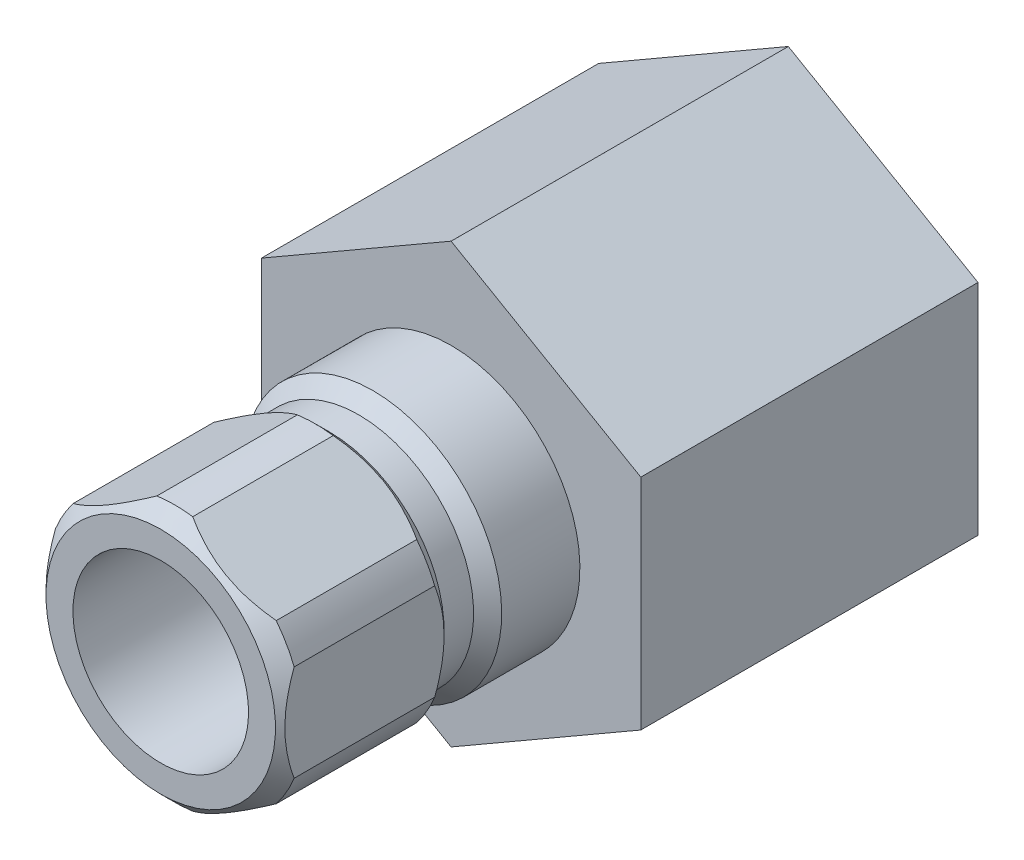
ISO-10303-21;
HEADER;
FILE_DESCRIPTION(('STEP AP214'),'2;1');
FILE_NAME('part.step','',(''),(''),'','','');
FILE_SCHEMA(('AUTOMOTIVE_DESIGN { 1 0 10303 214 1 1 1 1 }'));
ENDSEC;
DATA;
#1=APPLICATION_CONTEXT('core data for automotive mechanical design processes');
#2=APPLICATION_PROTOCOL_DEFINITION('international standard','automotive_design',2000,#1);
#3=PRODUCT_CONTEXT('',#1,'mechanical');
#4=PRODUCT('Part','Part','',(#3));
#5=PRODUCT_RELATED_PRODUCT_CATEGORY('part','',(#4));
#6=PRODUCT_DEFINITION_FORMATION('','',#4);
#7=PRODUCT_DEFINITION_CONTEXT('part definition',#1,'design');
#8=PRODUCT_DEFINITION('design','',#6,#7);
#9=PRODUCT_DEFINITION_SHAPE('','',#8);
#10=(LENGTH_UNIT() NAMED_UNIT(*) SI_UNIT(.MILLI.,.METRE.));
#11=(NAMED_UNIT(*) PLANE_ANGLE_UNIT() SI_UNIT($,.RADIAN.));
#12=(NAMED_UNIT(*) SI_UNIT($,.STERADIAN.) SOLID_ANGLE_UNIT());
#13=UNCERTAINTY_MEASURE_WITH_UNIT(LENGTH_MEASURE(1.E-05),#10,'distance_accuracy_value','');
#14=(GEOMETRIC_REPRESENTATION_CONTEXT(3) GLOBAL_UNCERTAINTY_ASSIGNED_CONTEXT((#13)) GLOBAL_UNIT_ASSIGNED_CONTEXT((#10,
#11,#12)) REPRESENTATION_CONTEXT('',''));
#15=CARTESIAN_POINT('',(0.,0.,0.));
#16=DIRECTION('',(0.,0.,1.));
#17=DIRECTION('',(1.,0.,0.));
#18=AXIS2_PLACEMENT_3D('',#15,#16,#17);
#19=CARTESIAN_POINT('',(0.,0.,0.));
#20=DIRECTION('',(0.,0.,-1.));
#21=DIRECTION('',(0.,1.,0.));
#22=AXIS2_PLACEMENT_3D('',#19,#20,#21);
#23=CYLINDRICAL_SURFACE('',#22,6.985);
#24=DIRECTION('',(0.,0.,-1.));
#25=VECTOR('',#24,1.);
#26=CARTESIAN_POINT('',(-5.50323442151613,4.30170151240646,0.));
#27=LINE('',#26,#25);
#28=CARTESIAN_POINT('',(-5.50323442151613,4.30170151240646,7.366));
#29=VERTEX_POINT('',#28);
#30=CARTESIAN_POINT('',(-5.50323442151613,4.30170151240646,14.986));
#31=VERTEX_POINT('',#30);
#32=EDGE_CURVE('E54',#29,#31,#27,.F.);
#33=ORIENTED_EDGE('',*,*,#32,.F.);
#34=CARTESIAN_POINT('',(0.,0.,7.366));
#35=DIRECTION('',(0.,0.,-1.));
#36=DIRECTION('',(0.,1.,0.));
#37=AXIS2_PLACEMENT_3D('',#34,#35,#36);
#38=CIRCLE('',#37,6.985);
#39=CARTESIAN_POINT('',(-6.477,2.6150900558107,7.366));
#40=VERTEX_POINT('',#39);
#41=EDGE_CURVE('E231',#40,#29,#38,.T.);
#42=ORIENTED_EDGE('',*,*,#41,.F.);
#43=DIRECTION('',(0.,0.,-1.));
#44=VECTOR('',#43,1.);
#45=CARTESIAN_POINT('',(-6.477,2.6150900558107,0.));
#46=LINE('',#45,#44);
#47=CARTESIAN_POINT('',(-6.477,2.6150900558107,14.986));
#48=VERTEX_POINT('',#47);
#49=EDGE_CURVE('E411',#48,#40,#46,.T.);
#50=ORIENTED_EDGE('',*,*,#49,.F.);
#51=CARTESIAN_POINT('',(0.,0.,14.986));
#52=DIRECTION('',(0.,0.,-1.));
#53=DIRECTION('',(0.,1.,0.));
#54=AXIS2_PLACEMENT_3D('',#51,#52,#53);
#55=CIRCLE('',#54,6.985);
#56=EDGE_CURVE('E236',#48,#31,#55,.T.);
#57=ORIENTED_EDGE('',*,*,#56,.T.);
#58=EDGE_LOOP('',(#33,#42,#50,#57));
#59=FACE_BOUND('',#58,.T.);
#60=ADVANCED_FACE('F35',(#59),#23,.T.);
#61=DIRECTION('',(0.,0.,-1.));
#62=VECTOR('',#61,1.);
#63=CARTESIAN_POINT('',(-6.477,-2.6150900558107,0.));
#64=LINE('',#63,#62);
#65=CARTESIAN_POINT('',(-6.477,-2.6150900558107,7.366));
#66=VERTEX_POINT('',#65);
#67=CARTESIAN_POINT('',(-6.477,-2.6150900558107,14.986));
#68=VERTEX_POINT('',#67);
#69=EDGE_CURVE('E62',#66,#68,#64,.F.);
#70=ORIENTED_EDGE('',*,*,#69,.F.);
#71=CARTESIAN_POINT('',(-5.50323442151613,-4.30170151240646,7.366));
#72=VERTEX_POINT('',#71);
#73=EDGE_CURVE('E468',#72,#66,#38,.T.);
#74=ORIENTED_EDGE('',*,*,#73,.F.);
#75=DIRECTION('',(0.,0.,-1.));
#76=VECTOR('',#75,1.);
#77=CARTESIAN_POINT('',(-5.50323442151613,-4.30170151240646,0.));
#78=LINE('',#77,#76);
#79=CARTESIAN_POINT('',(-5.50323442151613,-4.30170151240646,14.986));
#80=VERTEX_POINT('',#79);
#81=EDGE_CURVE('E406',#80,#72,#78,.T.);
#82=ORIENTED_EDGE('',*,*,#81,.F.);
#83=EDGE_CURVE('E241',#80,#68,#55,.T.);
#84=ORIENTED_EDGE('',*,*,#83,.T.);
#85=EDGE_LOOP('',(#70,#74,#82,#84));
#86=FACE_BOUND('',#85,.T.);
#87=ADVANCED_FACE('F403',(#86),#23,.T.);
#88=DIRECTION('',(0.,0.,-1.));
#89=VECTOR('',#88,1.);
#90=CARTESIAN_POINT('',(-0.973765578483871,-6.91679156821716,0.));
#91=LINE('',#90,#89);
#92=CARTESIAN_POINT('',(-0.973765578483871,-6.91679156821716,7.366));
#93=VERTEX_POINT('',#92);
#94=CARTESIAN_POINT('',(-0.973765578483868,-6.91679156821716,14.986));
#95=VERTEX_POINT('',#94);
#96=EDGE_CURVE('E417',#93,#95,#91,.F.);
#97=ORIENTED_EDGE('',*,*,#96,.F.);
#98=CARTESIAN_POINT('',(0.973765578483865,-6.91679156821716,7.366));
#99=VERTEX_POINT('',#98);
#100=EDGE_CURVE('E466',#99,#93,#38,.T.);
#101=ORIENTED_EDGE('',*,*,#100,.F.);
#102=DIRECTION('',(0.,0.,-1.));
#103=VECTOR('',#102,1.);
#104=CARTESIAN_POINT('',(0.973765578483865,-6.91679156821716,0.));
#105=LINE('',#104,#103);
#106=CARTESIAN_POINT('',(0.973765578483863,-6.91679156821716,14.986));
#107=VERTEX_POINT('',#106);
#108=EDGE_CURVE('E452',#107,#99,#105,.T.);
#109=ORIENTED_EDGE('',*,*,#108,.F.);
#110=EDGE_CURVE('E234',#107,#95,#55,.T.);
#111=ORIENTED_EDGE('',*,*,#110,.T.);
#112=EDGE_LOOP('',(#97,#101,#109,#111));
#113=FACE_BOUND('',#112,.T.);
#114=ADVANCED_FACE('F465',(#113),#23,.T.);
#115=DIRECTION('',(0.,0.,-1.));
#116=VECTOR('',#115,1.);
#117=CARTESIAN_POINT('',(5.50323442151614,-4.30170151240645,0.));
#118=LINE('',#117,#116);
#119=CARTESIAN_POINT('',(5.50323442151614,-4.30170151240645,7.366));
#120=VERTEX_POINT('',#119);
#121=CARTESIAN_POINT('',(5.50323442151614,-4.30170151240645,14.986));
#122=VERTEX_POINT('',#121);
#123=EDGE_CURVE('E454',#120,#122,#118,.F.);
#124=ORIENTED_EDGE('',*,*,#123,.F.);
#125=CARTESIAN_POINT('',(6.477,-2.6150900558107,7.366));
#126=VERTEX_POINT('',#125);
#127=EDGE_CURVE('E393',#126,#120,#38,.T.);
#128=ORIENTED_EDGE('',*,*,#127,.F.);
#129=DIRECTION('',(0.,0.,-1.));
#130=VECTOR('',#129,1.);
#131=CARTESIAN_POINT('',(6.477,-2.6150900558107,0.));
#132=LINE('',#131,#130);
#133=CARTESIAN_POINT('',(6.477,-2.6150900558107,14.986));
#134=VERTEX_POINT('',#133);
#135=EDGE_CURVE('E385',#134,#126,#132,.T.);
#136=ORIENTED_EDGE('',*,*,#135,.F.);
#137=EDGE_CURVE('E227',#134,#122,#55,.T.);
#138=ORIENTED_EDGE('',*,*,#137,.T.);
#139=EDGE_LOOP('',(#124,#128,#136,#138));
#140=FACE_BOUND('',#139,.T.);
#141=ADVANCED_FACE('F391',(#140),#23,.T.);
#142=DIRECTION('',(0.,0.,-1.));
#143=VECTOR('',#142,1.);
#144=CARTESIAN_POINT('',(6.477,2.6150900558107,0.));
#145=LINE('',#144,#143);
#146=CARTESIAN_POINT('',(6.477,2.6150900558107,7.366));
#147=VERTEX_POINT('',#146);
#148=CARTESIAN_POINT('',(6.477,2.6150900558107,14.986));
#149=VERTEX_POINT('',#148);
#150=EDGE_CURVE('E387',#147,#149,#145,.F.);
#151=ORIENTED_EDGE('',*,*,#150,.F.);
#152=CARTESIAN_POINT('',(5.50323442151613,4.30170151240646,7.366));
#153=VERTEX_POINT('',#152);
#154=EDGE_CURVE('E220',#153,#147,#38,.T.);
#155=ORIENTED_EDGE('',*,*,#154,.F.);
#156=DIRECTION('',(0.,0.,-1.));
#157=VECTOR('',#156,1.);
#158=CARTESIAN_POINT('',(5.50323442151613,4.30170151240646,0.));
#159=LINE('',#158,#157);
#160=CARTESIAN_POINT('',(5.50323442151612,4.30170151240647,14.986));
#161=VERTEX_POINT('',#160);
#162=EDGE_CURVE('E202',#161,#153,#159,.T.);
#163=ORIENTED_EDGE('',*,*,#162,.F.);
#164=EDGE_CURVE('E218',#161,#149,#55,.T.);
#165=ORIENTED_EDGE('',*,*,#164,.T.);
#166=EDGE_LOOP('',(#151,#155,#163,#165));
#167=FACE_BOUND('',#166,.T.);
#168=ADVANCED_FACE('F217',(#167),#23,.T.);
#169=CARTESIAN_POINT('',(0.,11.87831,-18.288));
#170=DIRECTION('',(0.,0.,-1.));
#171=DIRECTION('',(0.,1.,0.));
#172=AXIS2_PLACEMENT_3D('',#169,#170,#171);
#173=PLANE('',#172);
#174=CARTESIAN_POINT('',(0.,0.,-18.288));
#175=DIRECTION('',(0.,0.,-1.));
#176=DIRECTION('',(0.,1.,0.));
#177=AXIS2_PLACEMENT_3D('',#174,#175,#176);
#178=CIRCLE('',#177,7.71453341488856);
#179=CARTESIAN_POINT('',(0.,7.71453341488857,-18.288));
#180=VERTEX_POINT('',#179);
#181=EDGE_CURVE('E492',#180,#180,#178,.T.);
#182=ORIENTED_EDGE('',*,*,#181,.F.);
#183=EDGE_LOOP('',(#182));
#184=FACE_BOUND('',#183,.T.);
#185=CARTESIAN_POINT('',(0.,0.,-18.288));
#186=DIRECTION('',(0.,0.,-1.));
#187=DIRECTION('',(0.,1.,0.));
#188=AXIS2_PLACEMENT_3D('',#185,#186,#187);
#189=CIRCLE('',#188,11.87831);
#190=CARTESIAN_POINT('',(-10.287,5.93901334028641,-18.288));
#191=VERTEX_POINT('',#190);
#192=CARTESIAN_POINT('',(-10.2868364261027,5.93929665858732,-18.288));
#193=VERTEX_POINT('',#192);
#194=EDGE_CURVE('E490',#191,#193,#189,.T.);
#195=ORIENTED_EDGE('',*,*,#194,.T.);
#196=DIRECTION('',(-0.866025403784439,-0.5,0.));
#197=VECTOR('',#196,1.);
#198=CARTESIAN_POINT('',(0.,11.8784044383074,-18.288));
#199=LINE('',#198,#197);
#200=CARTESIAN_POINT('',(-0.000163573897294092,11.8783099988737,-18.288));
#201=VERTEX_POINT('',#200);
#202=EDGE_CURVE('E294',#201,#193,#199,.T.);
#203=ORIENTED_EDGE('',*,*,#202,.F.);
#204=CARTESIAN_POINT('',(0.000163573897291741,11.8783099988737,-18.288));
#205=VERTEX_POINT('',#204);
#206=EDGE_CURVE('E487',#201,#205,#189,.T.);
#207=ORIENTED_EDGE('',*,*,#206,.T.);
#208=DIRECTION('',(-0.866025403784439,0.5,0.));
#209=VECTOR('',#208,1.);
#210=CARTESIAN_POINT('',(10.287,5.93920221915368,-18.288));
#211=LINE('',#210,#209);
#212=CARTESIAN_POINT('',(10.2868364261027,5.93929665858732,-18.288));
#213=VERTEX_POINT('',#212);
#214=EDGE_CURVE('E284',#213,#205,#211,.T.);
#215=ORIENTED_EDGE('',*,*,#214,.F.);
#216=CARTESIAN_POINT('',(10.287,5.93901334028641,-18.288));
#217=VERTEX_POINT('',#216);
#218=EDGE_CURVE('E491',#213,#217,#189,.T.);
#219=ORIENTED_EDGE('',*,*,#218,.T.);
#220=DIRECTION('',(0.,1.,0.));
#221=VECTOR('',#220,1.);
#222=CARTESIAN_POINT('',(10.287,-5.93920221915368,-18.288));
#223=LINE('',#222,#221);
#224=CARTESIAN_POINT('',(10.287,-5.93901334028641,-18.288));
#225=VERTEX_POINT('',#224);
#226=EDGE_CURVE('E286',#225,#217,#223,.T.);
#227=ORIENTED_EDGE('',*,*,#226,.F.);
#228=CARTESIAN_POINT('',(10.2868364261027,-5.93929665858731,-18.288));
#229=VERTEX_POINT('',#228);
#230=EDGE_CURVE('E547',#225,#229,#189,.T.);
#231=ORIENTED_EDGE('',*,*,#230,.T.);
#232=DIRECTION('',(0.866025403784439,0.5,0.));
#233=VECTOR('',#232,1.);
#234=CARTESIAN_POINT('',(0.,-11.8784044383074,-18.288));
#235=LINE('',#234,#233);
#236=CARTESIAN_POINT('',(0.000163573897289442,-11.8783099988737,-18.288));
#237=VERTEX_POINT('',#236);
#238=EDGE_CURVE('E288',#237,#229,#235,.T.);
#239=ORIENTED_EDGE('',*,*,#238,.F.);
#240=CARTESIAN_POINT('',(-0.000163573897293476,-11.8783099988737,-18.288));
#241=VERTEX_POINT('',#240);
#242=EDGE_CURVE('E550',#237,#241,#189,.T.);
#243=ORIENTED_EDGE('',*,*,#242,.T.);
#244=DIRECTION('',(0.866025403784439,-0.5,0.));
#245=VECTOR('',#244,1.);
#246=CARTESIAN_POINT('',(-10.287,-5.93920221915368,-18.288));
#247=LINE('',#246,#245);
#248=CARTESIAN_POINT('',(-10.2868364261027,-5.93929665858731,-18.288));
#249=VERTEX_POINT('',#248);
#250=EDGE_CURVE('E290',#249,#241,#247,.T.);
#251=ORIENTED_EDGE('',*,*,#250,.F.);
#252=CARTESIAN_POINT('',(-10.287,-5.93901334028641,-18.288));
#253=VERTEX_POINT('',#252);
#254=EDGE_CURVE('E552',#249,#253,#189,.T.);
#255=ORIENTED_EDGE('',*,*,#254,.T.);
#256=DIRECTION('',(0.,-1.,0.));
#257=VECTOR('',#256,1.);
#258=CARTESIAN_POINT('',(-10.287,5.93920221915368,-18.288));
#259=LINE('',#258,#257);
#260=EDGE_CURVE('E292',#191,#253,#259,.T.);
#261=ORIENTED_EDGE('',*,*,#260,.F.);
#262=EDGE_LOOP('',(#195,#203,#207,#215,#219,#227,#231,#239,#243,#251,#255,#261));
#263=FACE_BOUND('',#262,.T.);
#264=ADVANCED_FACE('F559',(#184,#263),#173,.T.);
#265=CARTESIAN_POINT('',(0.,0.,0.));
#266=DIRECTION('',(0.,0.,-1.));
#267=DIRECTION('',(0.,1.,0.));
#268=AXIS2_PLACEMENT_3D('',#265,#266,#267);
#269=CYLINDRICAL_SURFACE('',#268,11.87831);
#270=ORIENTED_EDGE('',*,*,#206,.F.);
#271=DIRECTION('',(0.,0.,-1.));
#272=VECTOR('',#271,1.);
#273=CARTESIAN_POINT('',(-0.000163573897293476,11.8783099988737,0.));
#274=LINE('',#273,#272);
#275=CARTESIAN_POINT('',(-0.000163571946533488,11.87831,0.));
#276=VERTEX_POINT('',#275);
#277=EDGE_CURVE('E246',#201,#276,#274,.F.);
#278=ORIENTED_EDGE('',*,*,#277,.T.);
#279=CARTESIAN_POINT('',(0.,0.,0.));
#280=DIRECTION('',(0.,0.,-1.));
#281=DIRECTION('',(0.,1.,0.));
#282=AXIS2_PLACEMENT_3D('',#279,#280,#281);
#283=CIRCLE('',#282,11.87831);
#284=CARTESIAN_POINT('',(0.00016357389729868,11.8783099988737,0.));
#285=VERTEX_POINT('',#284);
#286=EDGE_CURVE('E482',#276,#285,#283,.T.);
#287=ORIENTED_EDGE('',*,*,#286,.T.);
#288=DIRECTION('',(0.,0.,-1.));
#289=VECTOR('',#288,1.);
#290=CARTESIAN_POINT('',(0.000163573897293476,11.8783099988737,0.));
#291=LINE('',#290,#289);
#292=EDGE_CURVE('E257',#285,#205,#291,.T.);
#293=ORIENTED_EDGE('',*,*,#292,.T.);
#294=EDGE_LOOP('',(#270,#278,#287,#293));
#295=FACE_BOUND('',#294,.T.);
#296=ADVANCED_FACE('F569',(#295),#269,.T.);
#297=CARTESIAN_POINT('',(-10.287,5.93901334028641,0.));
#298=VERTEX_POINT('',#297);
#299=CARTESIAN_POINT('',(-10.2868364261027,5.93929665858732,0.));
#300=VERTEX_POINT('',#299);
#301=EDGE_CURVE('E485',#298,#300,#283,.T.);
#302=ORIENTED_EDGE('',*,*,#301,.T.);
#303=DIRECTION('',(0.,0.,-1.));
#304=VECTOR('',#303,1.);
#305=CARTESIAN_POINT('',(-10.2868364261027,5.93929665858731,0.));
#306=LINE('',#305,#304);
#307=EDGE_CURVE('E251',#300,#193,#306,.T.);
#308=ORIENTED_EDGE('',*,*,#307,.T.);
#309=ORIENTED_EDGE('',*,*,#194,.F.);
#310=DIRECTION('',(0.,0.,-1.));
#311=VECTOR('',#310,1.);
#312=CARTESIAN_POINT('',(-10.287,5.93901334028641,0.));
#313=LINE('',#312,#311);
#314=EDGE_CURVE('E278',#191,#298,#313,.F.);
#315=ORIENTED_EDGE('',*,*,#314,.T.);
#316=EDGE_LOOP('',(#302,#308,#309,#315));
#317=FACE_BOUND('',#316,.T.);
#318=ADVANCED_FACE('F522',(#317),#269,.T.);
#319=ORIENTED_EDGE('',*,*,#218,.F.);
#320=DIRECTION('',(0.,0.,-1.));
#321=VECTOR('',#320,1.);
#322=CARTESIAN_POINT('',(10.2868364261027,5.93929665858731,0.));
#323=LINE('',#322,#321);
#324=CARTESIAN_POINT('',(10.2868364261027,5.93929665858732,0.));
#325=VERTEX_POINT('',#324);
#326=EDGE_CURVE('E254',#213,#325,#323,.F.);
#327=ORIENTED_EDGE('',*,*,#326,.T.);
#328=CARTESIAN_POINT('',(10.287,5.93901334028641,0.));
#329=VERTEX_POINT('',#328);
#330=EDGE_CURVE('E486',#325,#329,#283,.T.);
#331=ORIENTED_EDGE('',*,*,#330,.T.);
#332=DIRECTION('',(0.,0.,-1.));
#333=VECTOR('',#332,1.);
#334=CARTESIAN_POINT('',(10.287,5.93901334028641,0.));
#335=LINE('',#334,#333);
#336=EDGE_CURVE('E263',#329,#217,#335,.T.);
#337=ORIENTED_EDGE('',*,*,#336,.T.);
#338=EDGE_LOOP('',(#319,#327,#331,#337));
#339=FACE_BOUND('',#338,.T.);
#340=ADVANCED_FACE('F541',(#339),#269,.T.);
#341=ORIENTED_EDGE('',*,*,#230,.F.);
#342=DIRECTION('',(0.,0.,-1.));
#343=VECTOR('',#342,1.);
#344=CARTESIAN_POINT('',(10.287,-5.93901334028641,0.));
#345=LINE('',#344,#343);
#346=CARTESIAN_POINT('',(10.287,-5.93901334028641,0.));
#347=VERTEX_POINT('',#346);
#348=EDGE_CURVE('E260',#225,#347,#345,.F.);
#349=ORIENTED_EDGE('',*,*,#348,.T.);
#350=CARTESIAN_POINT('',(10.2868364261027,-5.93929665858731,0.));
#351=VERTEX_POINT('',#350);
#352=EDGE_CURVE('E531',#347,#351,#283,.T.);
#353=ORIENTED_EDGE('',*,*,#352,.T.);
#354=DIRECTION('',(0.,0.,-1.));
#355=VECTOR('',#354,1.);
#356=CARTESIAN_POINT('',(10.2868364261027,-5.93929665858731,0.));
#357=LINE('',#356,#355);
#358=EDGE_CURVE('E269',#351,#229,#357,.T.);
#359=ORIENTED_EDGE('',*,*,#358,.T.);
#360=EDGE_LOOP('',(#341,#349,#353,#359));
#361=FACE_BOUND('',#360,.T.);
#362=ADVANCED_FACE('F545',(#361),#269,.T.);
#363=ORIENTED_EDGE('',*,*,#242,.F.);
#364=DIRECTION('',(0.,0.,-1.));
#365=VECTOR('',#364,1.);
#366=CARTESIAN_POINT('',(0.000163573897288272,-11.8783099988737,0.));
#367=LINE('',#366,#365);
#368=CARTESIAN_POINT('',(0.000163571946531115,-11.87831,0.));
#369=VERTEX_POINT('',#368);
#370=EDGE_CURVE('E266',#237,#369,#367,.F.);
#371=ORIENTED_EDGE('',*,*,#370,.T.);
#372=CARTESIAN_POINT('',(-0.000163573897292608,-11.8783099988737,0.));
#373=VERTEX_POINT('',#372);
#374=EDGE_CURVE('E527',#369,#373,#283,.T.);
#375=ORIENTED_EDGE('',*,*,#374,.T.);
#376=DIRECTION('',(0.,0.,-1.));
#377=VECTOR('',#376,1.);
#378=CARTESIAN_POINT('',(-0.000163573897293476,-11.8783099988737,0.));
#379=LINE('',#378,#377);
#380=EDGE_CURVE('E275',#373,#241,#379,.T.);
#381=ORIENTED_EDGE('',*,*,#380,.T.);
#382=EDGE_LOOP('',(#363,#371,#375,#381));
#383=FACE_BOUND('',#382,.T.);
#384=ADVANCED_FACE('F562',(#383),#269,.T.);
#385=ORIENTED_EDGE('',*,*,#254,.F.);
#386=DIRECTION('',(0.,0.,-1.));
#387=VECTOR('',#386,1.);
#388=CARTESIAN_POINT('',(-10.2868364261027,-5.93929665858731,0.));
#389=LINE('',#388,#387);
#390=CARTESIAN_POINT('',(-10.2868364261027,-5.93929665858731,0.));
#391=VERTEX_POINT('',#390);
#392=EDGE_CURVE('E272',#249,#391,#389,.F.);
#393=ORIENTED_EDGE('',*,*,#392,.T.);
#394=CARTESIAN_POINT('',(-10.287,-5.93901334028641,0.));
#395=VERTEX_POINT('',#394);
#396=EDGE_CURVE('E525',#391,#395,#283,.T.);
#397=ORIENTED_EDGE('',*,*,#396,.T.);
#398=DIRECTION('',(0.,0.,-1.));
#399=VECTOR('',#398,1.);
#400=CARTESIAN_POINT('',(-10.287,-5.93901334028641,0.));
#401=LINE('',#400,#399);
#402=EDGE_CURVE('E281',#395,#253,#401,.T.);
#403=ORIENTED_EDGE('',*,*,#402,.T.);
#404=EDGE_LOOP('',(#385,#393,#397,#403));
#405=FACE_BOUND('',#404,.T.);
#406=ADVANCED_FACE('F561',(#405),#269,.T.);
#407=CARTESIAN_POINT('',(0.,6.985,0.));
#408=DIRECTION('',(0.,0.,1.));
#409=DIRECTION('',(0.,-1.,0.));
#410=AXIS2_PLACEMENT_3D('',#407,#408,#409);
#411=PLANE('',#410);
#412=CARTESIAN_POINT('',(0.,0.,0.));
#413=DIRECTION('',(0.,0.,-1.));
#414=DIRECTION('',(0.,1.,0.));
#415=AXIS2_PLACEMENT_3D('',#412,#413,#414);
#416=CIRCLE('',#415,6.985);
#417=CARTESIAN_POINT('',(0.,6.985,0.));
#418=VERTEX_POINT('',#417);
#419=EDGE_CURVE('E479',#418,#418,#416,.T.);
#420=ORIENTED_EDGE('',*,*,#419,.T.);
#421=EDGE_LOOP('',(#420));
#422=FACE_BOUND('',#421,.T.);
#423=ORIENTED_EDGE('',*,*,#286,.F.);
#424=DIRECTION('',(-0.866025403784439,-0.5,0.));
#425=VECTOR('',#424,1.);
#426=CARTESIAN_POINT('',(-2.11890627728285,10.6550533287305,0.));
#427=LINE('',#426,#425);
#428=EDGE_CURVE('E211',#276,#300,#427,.T.);
#429=ORIENTED_EDGE('',*,*,#428,.T.);
#430=ORIENTED_EDGE('',*,*,#301,.F.);
#431=DIRECTION('',(0.,-1.,0.));
#432=VECTOR('',#431,1.);
#433=CARTESIAN_POINT('',(-10.287,6.985,0.));
#434=LINE('',#433,#432);
#435=EDGE_CURVE('E501',#298,#395,#434,.T.);
#436=ORIENTED_EDGE('',*,*,#435,.T.);
#437=ORIENTED_EDGE('',*,*,#396,.F.);
#438=DIRECTION('',(0.866025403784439,-0.5,0.));
#439=VECTOR('',#438,1.);
#440=CARTESIAN_POINT('',(-8.16809372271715,-7.16255332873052,0.));
#441=LINE('',#440,#439);
#442=EDGE_CURVE('E504',#391,#373,#441,.T.);
#443=ORIENTED_EDGE('',*,*,#442,.T.);
#444=ORIENTED_EDGE('',*,*,#374,.F.);
#445=DIRECTION('',(0.866025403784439,0.5,0.));
#446=VECTOR('',#445,1.);
#447=CARTESIAN_POINT('',(8.16809372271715,-7.16255332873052,0.));
#448=LINE('',#447,#446);
#449=EDGE_CURVE('E507',#369,#351,#448,.T.);
#450=ORIENTED_EDGE('',*,*,#449,.T.);
#451=ORIENTED_EDGE('',*,*,#352,.F.);
#452=DIRECTION('',(0.,1.,0.));
#453=VECTOR('',#452,1.);
#454=CARTESIAN_POINT('',(10.287,6.985,0.));
#455=LINE('',#454,#453);
#456=EDGE_CURVE('E510',#347,#329,#455,.T.);
#457=ORIENTED_EDGE('',*,*,#456,.T.);
#458=ORIENTED_EDGE('',*,*,#330,.F.);
#459=DIRECTION('',(-0.866025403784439,0.5,0.));
#460=VECTOR('',#459,1.);
#461=CARTESIAN_POINT('',(2.11890627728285,10.6550533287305,0.));
#462=LINE('',#461,#460);
#463=EDGE_CURVE('E513',#325,#285,#462,.T.);
#464=ORIENTED_EDGE('',*,*,#463,.T.);
#465=EDGE_LOOP('',(#423,#429,#430,#436,#437,#443,#444,#450,#451,#457,#458,#464));
#466=FACE_BOUND('',#465,.T.);
#467=ADVANCED_FACE('F520',(#422,#466),#411,.T.);
#468=CARTESIAN_POINT('',(0.,0.,0.));
#469=DIRECTION('',(0.,0.,-1.));
#470=DIRECTION('',(0.,1.,0.));
#471=AXIS2_PLACEMENT_3D('',#468,#469,#470);
#472=CYLINDRICAL_SURFACE('',#471,4.7625);
#473=CARTESIAN_POINT('',(0.,0.,-6.36270000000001));
#474=DIRECTION('',(0.,0.,-1.));
#475=DIRECTION('',(0.,1.,0.));
#476=AXIS2_PLACEMENT_3D('',#473,#474,#475);
#477=CIRCLE('',#476,4.7625);
#478=CARTESIAN_POINT('',(0.,4.7625,-6.36270000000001));
#479=VERTEX_POINT('',#478);
#480=EDGE_CURVE('E498',#479,#479,#477,.T.);
#481=ORIENTED_EDGE('',*,*,#480,.T.);
#482=EDGE_LOOP('',(#481));
#483=FACE_BOUND('',#482,.T.);
#484=CARTESIAN_POINT('',(0.,0.,15.748));
#485=DIRECTION('',(0.,0.,-1.));
#486=DIRECTION('',(0.,1.,0.));
#487=AXIS2_PLACEMENT_3D('',#484,#485,#486);
#488=CIRCLE('',#487,4.7625);
#489=CARTESIAN_POINT('',(0.,4.7625,15.748));
#490=VERTEX_POINT('',#489);
#491=EDGE_CURVE('E243',#490,#490,#488,.T.);
#492=ORIENTED_EDGE('',*,*,#491,.F.);
#493=EDGE_LOOP('',(#492));
#494=FACE_BOUND('',#493,.T.);
#495=ADVANCED_FACE('F37',(#483,#494),#472,.F.);
#496=CARTESIAN_POINT('',(0.,4.7625,-6.36270000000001));
#497=DIRECTION('',(0.,0.,-1.));
#498=DIRECTION('',(0.,1.,0.));
#499=AXIS2_PLACEMENT_3D('',#496,#497,#498);
#500=PLANE('',#499);
#501=CARTESIAN_POINT('',(0.,0.,-6.36270000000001));
#502=DIRECTION('',(0.,0.,-1.));
#503=DIRECTION('',(0.,1.,0.));
#504=AXIS2_PLACEMENT_3D('',#501,#502,#503);
#505=CIRCLE('',#504,7.34187);
#506=CARTESIAN_POINT('',(0.,7.34187,-6.36270000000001));
#507=VERTEX_POINT('',#506);
#508=EDGE_CURVE('E495',#507,#507,#505,.T.);
#509=ORIENTED_EDGE('',*,*,#508,.T.);
#510=EDGE_LOOP('',(#509));
#511=FACE_BOUND('',#510,.T.);
#512=ORIENTED_EDGE('',*,*,#480,.F.);
#513=EDGE_LOOP('',(#512));
#514=FACE_BOUND('',#513,.T.);
#515=ADVANCED_FACE('F737',(#511,#514),#500,.T.);
#516=CARTESIAN_POINT('',(0.,0.,-6.36270000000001));
#517=DIRECTION('',(0.,0.,-1.));
#518=DIRECTION('',(0.,1.,0.));
#519=AXIS2_PLACEMENT_3D('',#516,#517,#518);
#520=CONICAL_SURFACE('',#519,7.34187,0.0312396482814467);
#521=ORIENTED_EDGE('',*,*,#181,.T.);
#522=EDGE_LOOP('',(#521));
#523=FACE_BOUND('',#522,.T.);
#524=ORIENTED_EDGE('',*,*,#508,.F.);
#525=EDGE_LOOP('',(#524));
#526=FACE_BOUND('',#525,.T.);
#527=ADVANCED_FACE('F727',(#523,#526),#520,.F.);
#528=CARTESIAN_POINT('',(0.,0.,0.));
#529=DIRECTION('',(0.,0.,-1.));
#530=DIRECTION('',(0.,1.,0.));
#531=AXIS2_PLACEMENT_3D('',#528,#529,#530);
#532=CYLINDRICAL_SURFACE('',#531,6.985);
#533=CARTESIAN_POINT('',(0.,0.,4.2418));
#534=DIRECTION('',(0.,0.,-1.));
#535=DIRECTION('',(0.,1.,0.));
#536=AXIS2_PLACEMENT_3D('',#533,#534,#535);
#537=CIRCLE('',#536,6.985);
#538=CARTESIAN_POINT('',(0.,6.985,4.2418));
#539=VERTEX_POINT('',#538);
#540=EDGE_CURVE('E476',#539,#539,#537,.T.);
#541=ORIENTED_EDGE('',*,*,#540,.T.);
#542=EDGE_LOOP('',(#541));
#543=FACE_BOUND('',#542,.T.);
#544=ORIENTED_EDGE('',*,*,#419,.F.);
#545=EDGE_LOOP('',(#544));
#546=FACE_BOUND('',#545,.T.);
#547=ADVANCED_FACE('F717',(#543,#546),#532,.T.);
#548=CARTESIAN_POINT('',(0.,0.,4.2418));
#549=DIRECTION('',(0.,0.,-1.));
#550=DIRECTION('',(0.,1.,0.));
#551=AXIS2_PLACEMENT_3D('',#548,#549,#550);
#552=CONICAL_SURFACE('',#551,6.985,0.785398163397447);
#553=CARTESIAN_POINT('',(0.,0.,5.0038));
#554=DIRECTION('',(0.,0.,-1.));
#555=DIRECTION('',(0.,1.,0.));
#556=AXIS2_PLACEMENT_3D('',#553,#554,#555);
#557=CIRCLE('',#556,6.223);
#558=CARTESIAN_POINT('',(0.,6.223,5.0038));
#559=VERTEX_POINT('',#558);
#560=EDGE_CURVE('E473',#559,#559,#557,.T.);
#561=ORIENTED_EDGE('',*,*,#560,.T.);
#562=EDGE_LOOP('',(#561));
#563=FACE_BOUND('',#562,.T.);
#564=ORIENTED_EDGE('',*,*,#540,.F.);
#565=EDGE_LOOP('',(#564));
#566=FACE_BOUND('',#565,.T.);
#567=ADVANCED_FACE('F707',(#563,#566),#552,.T.);
#568=CARTESIAN_POINT('',(0.,0.,0.));
#569=DIRECTION('',(0.,0.,-1.));
#570=DIRECTION('',(0.,1.,0.));
#571=AXIS2_PLACEMENT_3D('',#568,#569,#570);
#572=CYLINDRICAL_SURFACE('',#571,6.223);
#573=CARTESIAN_POINT('',(0.,0.,6.604));
#574=DIRECTION('',(0.,0.,-1.));
#575=DIRECTION('',(0.,1.,0.));
#576=AXIS2_PLACEMENT_3D('',#573,#574,#575);
#577=CIRCLE('',#576,6.223);
#578=CARTESIAN_POINT('',(0.,6.223,6.604));
#579=VERTEX_POINT('',#578);
#580=EDGE_CURVE('E470',#579,#579,#577,.T.);
#581=ORIENTED_EDGE('',*,*,#580,.T.);
#582=EDGE_LOOP('',(#581));
#583=FACE_BOUND('',#582,.T.);
#584=ORIENTED_EDGE('',*,*,#560,.F.);
#585=EDGE_LOOP('',(#584));
#586=FACE_BOUND('',#585,.T.);
#587=ADVANCED_FACE('F580',(#583,#586),#572,.T.);
#588=CARTESIAN_POINT('',(0.,0.,6.604));
#589=DIRECTION('',(0.,0.,1.));
#590=DIRECTION('',(0.,-1.,0.));
#591=AXIS2_PLACEMENT_3D('',#588,#589,#590);
#592=CONICAL_SURFACE('',#591,6.223,0.785398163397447);
#593=CARTESIAN_POINT('',(-0.973302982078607,6.91705864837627,7.3662));
#594=CARTESIAN_POINT('',(-1.15430521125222,6.81255696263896,7.28788330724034));
#595=CARTESIAN_POINT('',(-1.33782092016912,6.70660411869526,7.21664558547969));
#596=CARTESIAN_POINT('',(-1.70963160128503,6.49193912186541,7.09114753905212));
#597=CARTESIAN_POINT('',(-1.89793754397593,6.38322063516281,7.03693086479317));
#598=CARTESIAN_POINT('',(-2.27146153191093,6.16756646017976,6.95027563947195));
#599=CARTESIAN_POINT('',(-2.45655498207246,6.06070270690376,6.91713772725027));
#600=CARTESIAN_POINT('',(-2.82844640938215,5.8459910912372,6.87178043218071));
#601=CARTESIAN_POINT('',(-3.01524193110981,5.73814464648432,6.85953461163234));
#602=CARTESIAN_POINT('',(-3.39480578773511,5.51900335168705,6.85669437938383));
#603=CARTESIAN_POINT('',(-3.58757842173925,5.40770601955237,6.86678827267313));
#604=CARTESIAN_POINT('',(-3.97148128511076,5.18605959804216,6.9093291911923));
#605=CARTESIAN_POINT('',(-4.16260891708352,5.07571200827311,6.9418066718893));
#606=CARTESIAN_POINT('',(-4.54854122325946,4.85289388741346,7.02857263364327));
#607=CARTESIAN_POINT('',(-4.74321398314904,4.74049951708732,7.083635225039));
#608=CARTESIAN_POINT('',(-5.03141021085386,4.5741093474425,7.1799920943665));
#609=CARTESIAN_POINT('',(-5.12673323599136,4.5190745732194,7.21435772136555));
#610=CARTESIAN_POINT('',(-5.31613879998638,4.40972121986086,7.28725547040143));
#611=CARTESIAN_POINT('',(-5.41022179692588,4.35540237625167,7.32578600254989));
#612=CARTESIAN_POINT('',(-5.50369701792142,4.30143443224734,7.36620000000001));
#613=B_SPLINE_CURVE_WITH_KNOTS('',3,(#593,#594,#595,#596,#597,#598,#599,#600,#601,#602,#603,
#604,#605,#606,#607,#608,#609,#610,#611,#612),.UNSPECIFIED.,.F.,.F.,(4,2,2,2,2,2,2,2,2,4),(0.,
0.669810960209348,1.34132587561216,1.9892054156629,2.63626449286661,3.3035366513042,
3.9717185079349,4.66502165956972,5.0108826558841,5.35661208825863),.UNSPECIFIED.);
#614=CARTESIAN_POINT('',(-0.973765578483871,6.91679156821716,7.366));
#615=VERTEX_POINT('',#614);
#616=EDGE_CURVE('E296',#615,#29,#613,.T.);
#617=ORIENTED_EDGE('',*,*,#616,.F.);
#618=CARTESIAN_POINT('',(0.973765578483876,6.91679156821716,7.366));
#619=VERTEX_POINT('',#618);
#620=EDGE_CURVE('E226',#615,#619,#38,.T.);
#621=ORIENTED_EDGE('',*,*,#620,.T.);
#622=CARTESIAN_POINT('',(5.50369701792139,4.30143443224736,7.3662));
#623=CARTESIAN_POINT('',(5.32269478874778,4.40593611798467,7.28788330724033));
#624=CARTESIAN_POINT('',(5.13917907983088,4.51188896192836,7.21664558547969));
#625=CARTESIAN_POINT('',(4.76736839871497,4.72655395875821,7.09114753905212));
#626=CARTESIAN_POINT('',(4.57906245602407,4.83527244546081,7.03693086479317));
#627=CARTESIAN_POINT('',(4.20553846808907,5.05092662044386,6.95027563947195));
#628=CARTESIAN_POINT('',(4.02044501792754,5.15779037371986,6.91713772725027));
#629=CARTESIAN_POINT('',(3.64855359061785,5.37250198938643,6.87178043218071));
#630=CARTESIAN_POINT('',(3.46175806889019,5.48034843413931,6.85953461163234));
#631=CARTESIAN_POINT('',(3.08219421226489,5.69948972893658,6.85669437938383));
#632=CARTESIAN_POINT('',(2.88942157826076,5.81078706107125,6.86678827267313));
#633=CARTESIAN_POINT('',(2.50551871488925,6.03243348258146,6.9093291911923));
#634=CARTESIAN_POINT('',(2.31439108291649,6.14278107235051,6.9418066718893));
#635=CARTESIAN_POINT('',(1.92845877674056,6.36559919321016,7.02857263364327));
#636=CARTESIAN_POINT('',(1.73378601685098,6.47799356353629,7.08363522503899));
#637=CARTESIAN_POINT('',(1.44558978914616,6.6443837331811,7.17999209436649));
#638=CARTESIAN_POINT('',(1.35026676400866,6.69941850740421,7.21435772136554));
#639=CARTESIAN_POINT('',(1.16086120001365,6.80877186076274,7.28725547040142));
#640=CARTESIAN_POINT('',(1.06677820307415,6.86309070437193,7.32578600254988));
#641=CARTESIAN_POINT('',(0.97330298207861,6.91705864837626,7.3662));
#642=B_SPLINE_CURVE_WITH_KNOTS('',3,(#622,#623,#624,#625,#626,#627,#628,#629,#630,#631,#632,
#633,#634,#635,#636,#637,#638,#639,#640,#641),.UNSPECIFIED.,.F.,.F.,(4,2,2,2,2,2,2,2,2,4),(0.,
0.669810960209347,1.34132587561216,1.9892054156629,2.63626449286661,3.30353665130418,
3.97171850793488,4.66502165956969,5.01088265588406,5.35661208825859),.UNSPECIFIED.);
#643=EDGE_CURVE('E394',#153,#619,#642,.T.);
#644=ORIENTED_EDGE('',*,*,#643,.F.);
#645=ORIENTED_EDGE('',*,*,#154,.T.);
#646=CARTESIAN_POINT('',(6.477,-7.50531717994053,10.2946933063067));
#647=CARTESIAN_POINT('',(6.477,-7.32278230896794,10.1565337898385));
#648=CARTESIAN_POINT('',(6.477,-7.13923073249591,10.0196957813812));
#649=CARTESIAN_POINT('',(6.477,-6.76969107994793,9.74925615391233));
#650=CARTESIAN_POINT('',(6.477,-6.58370240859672,9.61565534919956));
#651=CARTESIAN_POINT('',(6.477,-6.20752484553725,9.35133325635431));
#652=CARTESIAN_POINT('',(6.477,-6.01731457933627,9.22064228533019));
#653=CARTESIAN_POINT('',(6.477,-5.63367369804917,8.96409124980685));
#654=CARTESIAN_POINT('',(6.477,-5.44024331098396,8.83823084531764));
#655=CARTESIAN_POINT('',(6.477,-5.03831720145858,8.58528971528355));
#656=CARTESIAN_POINT('',(6.477,-4.8295984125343,8.45856164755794));
#657=CARTESIAN_POINT('',(6.477,-4.40728395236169,8.21337587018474));
#658=CARTESIAN_POINT('',(6.477,-4.19368750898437,8.09491948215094));
#659=CARTESIAN_POINT('',(6.477,-3.7616267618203,7.8688284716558));
#660=CARTESIAN_POINT('',(6.477,-3.54317924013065,7.76116202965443));
#661=CARTESIAN_POINT('',(6.477,-3.100295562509,7.55906153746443));
#662=CARTESIAN_POINT('',(6.477,-2.87586219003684,7.46462146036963));
#663=CARTESIAN_POINT('',(6.477,-2.43955826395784,7.2995033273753));
#664=CARTESIAN_POINT('',(6.477,-2.22819339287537,7.2275028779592));
#665=CARTESIAN_POINT('',(6.477,-1.80033354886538,7.10045249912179));
#666=CARTESIAN_POINT('',(6.477,-1.58383822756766,7.0454037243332));
#667=CARTESIAN_POINT('',(6.477,-1.15063390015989,6.95606140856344));
#668=CARTESIAN_POINT('',(6.477,-0.934000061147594,6.92140936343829));
#669=CARTESIAN_POINT('',(6.477,-0.498364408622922,6.87354056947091));
#670=CARTESIAN_POINT('',(6.477,-0.279363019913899,6.86032003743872));
#671=CARTESIAN_POINT('',(6.477,0.150697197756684,6.85631642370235));
#672=CARTESIAN_POINT('',(6.477,0.36174869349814,6.8647176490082));
#673=CARTESIAN_POINT('',(6.477,0.782066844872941,6.90168275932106));
#674=CARTESIAN_POINT('',(6.477,0.991333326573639,6.93024858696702));
#675=CARTESIAN_POINT('',(6.477,1.41010575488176,7.00646246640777));
#676=CARTESIAN_POINT('',(6.477,1.6195513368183,7.05443689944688));
#677=CARTESIAN_POINT('',(6.477,2.03387291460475,7.16689535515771));
#678=CARTESIAN_POINT('',(6.477,2.2387492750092,7.23137805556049));
#679=CARTESIAN_POINT('',(6.477,2.66141718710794,7.38044013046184));
#680=CARTESIAN_POINT('',(6.477,2.87875617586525,7.46628961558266));
#681=CARTESIAN_POINT('',(6.477,3.30779766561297,7.65118196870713));
#682=CARTESIAN_POINT('',(6.477,3.51949749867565,7.75023095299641));
#683=CARTESIAN_POINT('',(6.477,3.9382898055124,7.95916705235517));
#684=CARTESIAN_POINT('',(6.477,4.14536521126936,8.069088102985));
#685=CARTESIAN_POINT('',(6.477,4.55475391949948,8.29734039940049));
#686=CARTESIAN_POINT('',(6.477,4.75706796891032,8.41567031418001));
#687=CARTESIAN_POINT('',(6.477,5.14761370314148,8.65303908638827));
#688=CARTESIAN_POINT('',(6.477,5.33604552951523,8.77175038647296));
#689=CARTESIAN_POINT('',(6.477,5.70967381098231,9.01417488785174));
#690=CARTESIAN_POINT('',(6.477,5.89487001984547,9.13788846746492));
#691=CARTESIAN_POINT('',(6.477,6.26095063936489,9.38840412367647));
#692=CARTESIAN_POINT('',(6.477,6.44185783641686,9.5151730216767));
#693=CARTESIAN_POINT('',(6.477,6.80119835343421,9.77207065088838));
#694=CARTESIAN_POINT('',(6.477,6.97963234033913,9.90219844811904));
#695=CARTESIAN_POINT('',(6.477,7.15703038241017,10.0336997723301));
#696=B_SPLINE_CURVE_WITH_KNOTS('',3,(#646,#647,#648,#649,#650,#651,#652,#653,#654,#655,#656,
#657,#658,#659,#660,#661,#662,#663,#664,#665,#666,#667,#668,#669,#670,#671,#672,#673,#674,#675,
#676,#677,#678,#679,#680,#681,#682,#683,#684,#685,#686,#687,#688,#689,#690,#691,#692,#693,#694,
#695),.UNSPECIFIED.,.F.,.F.,(4,2,2,2,2,2,2,2,2,2,2,2,2,2,2,2,2,2,2,2,2,2,2,2,4),(0.,
0.686790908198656,1.37375281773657,2.06603541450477,2.75826919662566,3.49065471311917,
4.22315698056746,4.95343127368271,5.68337170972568,6.352659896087,7.02199365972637,
7.67918147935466,8.33625327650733,8.96890298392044,9.6016136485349,10.2454384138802,
10.8892116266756,11.5897073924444,12.2905288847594,12.9936114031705,13.6965828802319,
14.3646145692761,15.0326968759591,15.6953618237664,16.3578444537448),.UNSPECIFIED.);
#697=EDGE_CURVE('E447',#126,#147,#696,.T.);
#698=ORIENTED_EDGE('',*,*,#697,.F.);
#699=ORIENTED_EDGE('',*,*,#127,.T.);
#700=CARTESIAN_POINT('',(0.973302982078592,-6.91705864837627,7.3662));
#701=CARTESIAN_POINT('',(1.15430521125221,-6.81255696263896,7.28788330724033));
#702=CARTESIAN_POINT('',(1.33782092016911,-6.70660411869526,7.21664558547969));
#703=CARTESIAN_POINT('',(1.70963160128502,-6.49193912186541,7.09114753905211));
#704=CARTESIAN_POINT('',(1.89793754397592,-6.38322063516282,7.03693086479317));
#705=CARTESIAN_POINT('',(2.27146153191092,-6.16756646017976,6.95027563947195));
#706=CARTESIAN_POINT('',(2.45655498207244,-6.06070270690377,6.91713772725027));
#707=CARTESIAN_POINT('',(2.82844640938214,-5.8459910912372,6.87178043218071));
#708=CARTESIAN_POINT('',(3.0152419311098,-5.73814464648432,6.85953461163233));
#709=CARTESIAN_POINT('',(3.3948057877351,-5.51900335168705,6.85669437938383));
#710=CARTESIAN_POINT('',(3.58757842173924,-5.40770601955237,6.86678827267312));
#711=CARTESIAN_POINT('',(3.97148128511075,-5.18605959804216,6.90932919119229));
#712=CARTESIAN_POINT('',(4.16260891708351,-5.07571200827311,6.94180667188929));
#713=CARTESIAN_POINT('',(4.54854122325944,-4.85289388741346,7.02857263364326));
#714=CARTESIAN_POINT('',(4.74321398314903,-4.74049951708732,7.08363522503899));
#715=CARTESIAN_POINT('',(5.03141021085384,-4.57410934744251,7.17999209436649));
#716=CARTESIAN_POINT('',(5.12673323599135,-4.5190745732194,7.21435772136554));
#717=CARTESIAN_POINT('',(5.31613879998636,-4.40972121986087,7.28725547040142));
#718=CARTESIAN_POINT('',(5.41022179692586,-4.35540237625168,7.32578600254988));
#719=CARTESIAN_POINT('',(5.50369701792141,-4.30143443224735,7.3662));
#720=B_SPLINE_CURVE_WITH_KNOTS('',3,(#700,#701,#702,#703,#704,#705,#706,#707,#708,#709,#710,
#711,#712,#713,#714,#715,#716,#717,#718,#719),.UNSPECIFIED.,.F.,.F.,(4,2,2,2,2,2,2,2,2,4),(0.,
0.669810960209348,1.34132587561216,1.98920541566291,2.63626449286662,3.3035366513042,
3.9717185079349,4.66502165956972,5.0108826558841,5.35661208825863),.UNSPECIFIED.);
#721=EDGE_CURVE('E456',#99,#120,#720,.T.);
#722=ORIENTED_EDGE('',*,*,#721,.F.);
#723=ORIENTED_EDGE('',*,*,#100,.T.);
#724=CARTESIAN_POINT('',(-5.50369701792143,-4.30143443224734,7.36620000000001));
#725=CARTESIAN_POINT('',(-5.32269478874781,-4.40593611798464,7.28788330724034));
#726=CARTESIAN_POINT('',(-5.13917907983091,-4.51188896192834,7.2166455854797));
#727=CARTESIAN_POINT('',(-4.767368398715,-4.72655395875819,7.09114753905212));
#728=CARTESIAN_POINT('',(-4.5790624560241,-4.83527244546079,7.03693086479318));
#729=CARTESIAN_POINT('',(-4.2055384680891,-5.05092662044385,6.95027563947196));
#730=CARTESIAN_POINT('',(-4.02044501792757,-5.15779037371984,6.91713772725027));
#731=CARTESIAN_POINT('',(-3.64855359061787,-5.37250198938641,6.87178043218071));
#732=CARTESIAN_POINT('',(-3.46175806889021,-5.48034843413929,6.85953461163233));
#733=CARTESIAN_POINT('',(-3.08219421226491,-5.69948972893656,6.85669437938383));
#734=CARTESIAN_POINT('',(-2.88942157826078,-5.81078706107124,6.86678827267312));
#735=CARTESIAN_POINT('',(-2.50551871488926,-6.03243348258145,6.90932919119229));
#736=CARTESIAN_POINT('',(-2.3143910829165,-6.1427810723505,6.94180667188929));
#737=CARTESIAN_POINT('',(-1.92845877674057,-6.36559919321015,7.02857263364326));
#738=CARTESIAN_POINT('',(-1.73378601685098,-6.47799356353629,7.08363522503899));
#739=CARTESIAN_POINT('',(-1.44558978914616,-6.6443837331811,7.17999209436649));
#740=CARTESIAN_POINT('',(-1.35026676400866,-6.69941850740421,7.21435772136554));
#741=CARTESIAN_POINT('',(-1.16086120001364,-6.80877186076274,7.28725547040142));
#742=CARTESIAN_POINT('',(-1.06677820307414,-6.86309070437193,7.32578600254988));
#743=CARTESIAN_POINT('',(-0.973302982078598,-6.91705864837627,7.3662));
#744=B_SPLINE_CURVE_WITH_KNOTS('',3,(#724,#725,#726,#727,#728,#729,#730,#731,#732,#733,#734,
#735,#736,#737,#738,#739,#740,#741,#742,#743),.UNSPECIFIED.,.F.,.F.,(4,2,2,2,2,2,2,2,2,4),(0.,
0.669810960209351,1.34132587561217,1.98920541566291,2.63626449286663,3.30353665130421,
3.97171850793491,4.66502165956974,5.01088265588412,5.35661208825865),.UNSPECIFIED.);
#745=EDGE_CURVE('E413',#72,#93,#744,.T.);
#746=ORIENTED_EDGE('',*,*,#745,.F.);
#747=ORIENTED_EDGE('',*,*,#73,.T.);
#748=CARTESIAN_POINT('',(-6.477,-7.50531717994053,10.2946933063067));
#749=CARTESIAN_POINT('',(-6.477,-7.32278230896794,10.1565337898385));
#750=CARTESIAN_POINT('',(-6.477,-7.13923073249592,10.0196957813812));
#751=CARTESIAN_POINT('',(-6.477,-6.76969107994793,9.74925615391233));
#752=CARTESIAN_POINT('',(-6.477,-6.58370240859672,9.61565534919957));
#753=CARTESIAN_POINT('',(-6.477,-6.20752484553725,9.35133325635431));
#754=CARTESIAN_POINT('',(-6.477,-6.01731457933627,9.22064228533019));
#755=CARTESIAN_POINT('',(-6.477,-5.63367369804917,8.96409124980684));
#756=CARTESIAN_POINT('',(-6.477,-5.44024331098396,8.83823084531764));
#757=CARTESIAN_POINT('',(-6.477,-5.03831720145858,8.58528971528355));
#758=CARTESIAN_POINT('',(-6.477,-4.8295984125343,8.45856164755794));
#759=CARTESIAN_POINT('',(-6.477,-4.4072839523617,8.21337587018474));
#760=CARTESIAN_POINT('',(-6.477,-4.19368750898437,8.09491948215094));
#761=CARTESIAN_POINT('',(-6.477,-3.7616267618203,7.8688284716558));
#762=CARTESIAN_POINT('',(-6.477,-3.54317924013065,7.76116202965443));
#763=CARTESIAN_POINT('',(-6.477,-3.100295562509,7.55906153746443));
#764=CARTESIAN_POINT('',(-6.477,-2.87586219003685,7.46462146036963));
#765=CARTESIAN_POINT('',(-6.477,-2.43955826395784,7.2995033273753));
#766=CARTESIAN_POINT('',(-6.477,-2.22819339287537,7.2275028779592));
#767=CARTESIAN_POINT('',(-6.477,-1.80033354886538,7.1004524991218));
#768=CARTESIAN_POINT('',(-6.477,-1.58383822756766,7.0454037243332));
#769=CARTESIAN_POINT('',(-6.477,-1.1506339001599,6.95606140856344));
#770=CARTESIAN_POINT('',(-6.477,-0.934000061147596,6.92140936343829));
#771=CARTESIAN_POINT('',(-6.477,-0.498364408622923,6.87354056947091));
#772=CARTESIAN_POINT('',(-6.477,-0.2793630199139,6.86032003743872));
#773=CARTESIAN_POINT('',(-6.477,0.150697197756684,6.85631642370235));
#774=CARTESIAN_POINT('',(-6.477,0.361748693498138,6.8647176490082));
#775=CARTESIAN_POINT('',(-6.477,0.78206684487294,6.90168275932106));
#776=CARTESIAN_POINT('',(-6.477,0.991333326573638,6.93024858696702));
#777=CARTESIAN_POINT('',(-6.477,1.41010575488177,7.00646246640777));
#778=CARTESIAN_POINT('',(-6.477,1.6195513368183,7.05443689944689));
#779=CARTESIAN_POINT('',(-6.477,2.03387291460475,7.16689535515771));
#780=CARTESIAN_POINT('',(-6.477,2.2387492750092,7.2313780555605));
#781=CARTESIAN_POINT('',(-6.477,2.66141718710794,7.38044013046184));
#782=CARTESIAN_POINT('',(-6.477,2.87875617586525,7.46628961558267));
#783=CARTESIAN_POINT('',(-6.477,3.30779766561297,7.65118196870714));
#784=CARTESIAN_POINT('',(-6.477,3.51949749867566,7.75023095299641));
#785=CARTESIAN_POINT('',(-6.477,3.9382898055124,7.95916705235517));
#786=CARTESIAN_POINT('',(-6.477,4.14536521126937,8.06908810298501));
#787=CARTESIAN_POINT('',(-6.477,4.55475391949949,8.29734039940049));
#788=CARTESIAN_POINT('',(-6.477,4.75706796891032,8.41567031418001));
#789=CARTESIAN_POINT('',(-6.477,5.14761370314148,8.65303908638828));
#790=CARTESIAN_POINT('',(-6.477,5.33604552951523,8.77175038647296));
#791=CARTESIAN_POINT('',(-6.477,5.70967381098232,9.01417488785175));
#792=CARTESIAN_POINT('',(-6.477,5.89487001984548,9.13788846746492));
#793=CARTESIAN_POINT('',(-6.477,6.2609506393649,9.38840412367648));
#794=CARTESIAN_POINT('',(-6.477,6.44185783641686,9.51517302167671));
#795=CARTESIAN_POINT('',(-6.477,6.80119835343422,9.77207065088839));
#796=CARTESIAN_POINT('',(-6.477,6.97963234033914,9.90219844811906));
#797=CARTESIAN_POINT('',(-6.477,7.15703038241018,10.0336997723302));
#798=B_SPLINE_CURVE_WITH_KNOTS('',3,(#748,#749,#750,#751,#752,#753,#754,#755,#756,#757,#758,
#759,#760,#761,#762,#763,#764,#765,#766,#767,#768,#769,#770,#771,#772,#773,#774,#775,#776,#777,
#778,#779,#780,#781,#782,#783,#784,#785,#786,#787,#788,#789,#790,#791,#792,#793,#794,#795,#796,
#797),.UNSPECIFIED.,.F.,.F.,(4,2,2,2,2,2,2,2,2,2,2,2,2,2,2,2,2,2,2,2,2,2,2,2,4),(0.,
0.686790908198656,1.37375281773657,2.06603541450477,2.75826919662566,3.49065471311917,
4.22315698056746,4.95343127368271,5.68337170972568,6.352659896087,7.02199365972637,
7.67918147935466,8.33625327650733,8.96890298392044,9.6016136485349,10.2454384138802,
10.8892116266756,11.5897073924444,12.2905288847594,12.9936114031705,13.6965828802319,
14.3646145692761,15.0326968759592,15.6953618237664,16.3578444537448),.UNSPECIFIED.);
#799=EDGE_CURVE('E415',#40,#66,#798,.F.);
#800=ORIENTED_EDGE('',*,*,#799,.F.);
#801=ORIENTED_EDGE('',*,*,#41,.T.);
#802=EDGE_LOOP('',(#617,#621,#644,#645,#698,#699,#722,#723,#746,#747,#800,#801));
#803=FACE_BOUND('',#802,.T.);
#804=ORIENTED_EDGE('',*,*,#580,.F.);
#805=EDGE_LOOP('',(#804));
#806=FACE_BOUND('',#805,.T.);
#807=ADVANCED_FACE('F303',(#803,#806),#592,.T.);
#808=DIRECTION('',(0.,0.,-1.));
#809=VECTOR('',#808,1.);
#810=CARTESIAN_POINT('',(-0.973765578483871,6.91679156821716,0.));
#811=LINE('',#810,#809);
#812=CARTESIAN_POINT('',(-0.973765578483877,6.91679156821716,14.986));
#813=VERTEX_POINT('',#812);
#814=EDGE_CURVE('E427',#813,#615,#811,.T.);
#815=ORIENTED_EDGE('',*,*,#814,.F.);
#816=CARTESIAN_POINT('',(0.973765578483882,6.91679156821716,14.986));
#817=VERTEX_POINT('',#816);
#818=EDGE_CURVE('E229',#813,#817,#55,.T.);
#819=ORIENTED_EDGE('',*,*,#818,.T.);
#820=DIRECTION('',(0.,0.,-1.));
#821=VECTOR('',#820,1.);
#822=CARTESIAN_POINT('',(0.973765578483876,6.91679156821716,0.));
#823=LINE('',#822,#821);
#824=EDGE_CURVE('E205',#619,#817,#823,.F.);
#825=ORIENTED_EDGE('',*,*,#824,.F.);
#826=ORIENTED_EDGE('',*,*,#620,.F.);
#827=EDGE_LOOP('',(#815,#819,#825,#826));
#828=FACE_BOUND('',#827,.T.);
#829=ADVANCED_FACE('F345',(#828),#23,.T.);
#830=CARTESIAN_POINT('',(0.,0.,14.986));
#831=DIRECTION('',(0.,0.,-1.));
#832=DIRECTION('',(0.,1.,0.));
#833=AXIS2_PLACEMENT_3D('',#830,#831,#832);
#834=CONICAL_SURFACE('',#833,6.985,0.785398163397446);
#835=CARTESIAN_POINT('',(-5.50369701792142,4.30143443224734,14.9858));
#836=CARTESIAN_POINT('',(-5.32269478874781,4.40593611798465,15.0641166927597));
#837=CARTESIAN_POINT('',(-5.13917907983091,4.51188896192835,15.1353544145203));
#838=CARTESIAN_POINT('',(-4.767368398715,4.7265539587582,15.2608524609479));
#839=CARTESIAN_POINT('',(-4.5790624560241,4.83527244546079,15.3150691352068));
#840=CARTESIAN_POINT('',(-4.2055384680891,5.05092662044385,15.401724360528));
#841=CARTESIAN_POINT('',(-4.02044501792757,5.15779037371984,15.4348622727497));
#842=CARTESIAN_POINT('',(-3.64855359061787,5.37250198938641,15.4802195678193));
#843=CARTESIAN_POINT('',(-3.46175806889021,5.48034843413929,15.4924653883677));
#844=CARTESIAN_POINT('',(-3.08219421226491,5.69948972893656,15.4953056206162));
#845=CARTESIAN_POINT('',(-2.88942157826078,5.81078706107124,15.4852117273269));
#846=CARTESIAN_POINT('',(-2.50551871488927,6.03243348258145,15.4426708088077));
#847=CARTESIAN_POINT('',(-2.31439108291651,6.1427810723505,15.4101933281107));
#848=CARTESIAN_POINT('',(-1.92845877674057,6.36559919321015,15.3234273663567));
#849=CARTESIAN_POINT('',(-1.73378601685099,6.47799356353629,15.268364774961));
#850=CARTESIAN_POINT('',(-1.44558978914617,6.6443837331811,15.1720079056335));
#851=CARTESIAN_POINT('',(-1.35026676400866,6.69941850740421,15.1376422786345));
#852=CARTESIAN_POINT('',(-1.16086120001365,6.80877186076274,15.0647445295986));
#853=CARTESIAN_POINT('',(-1.06677820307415,6.86309070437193,15.0262139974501));
#854=CARTESIAN_POINT('',(-0.973302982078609,6.91705864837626,14.9858));
#855=B_SPLINE_CURVE_WITH_KNOTS('',3,(#835,#836,#837,#838,#839,#840,#841,#842,#843,#844,#845,
#846,#847,#848,#849,#850,#851,#852,#853,#854),.UNSPECIFIED.,.F.,.F.,(4,2,2,2,2,2,2,2,2,4),(0.,
0.66981096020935,1.34132587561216,1.98920541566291,2.63626449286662,3.3035366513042,
3.9717185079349,4.66502165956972,5.0108826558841,5.35661208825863),.UNSPECIFIED.);
#856=EDGE_CURVE('E12',#31,#813,#855,.T.);
#857=ORIENTED_EDGE('',*,*,#856,.F.);
#858=ORIENTED_EDGE('',*,*,#56,.F.);
#859=CARTESIAN_POINT('',(-6.477,-7.50531717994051,12.0573066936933));
#860=CARTESIAN_POINT('',(-6.477,-7.32278230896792,12.1954662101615));
#861=CARTESIAN_POINT('',(-6.477,-7.1392307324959,12.3323042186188));
#862=CARTESIAN_POINT('',(-6.477,-6.76969107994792,12.6027438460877));
#863=CARTESIAN_POINT('',(-6.477,-6.5837024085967,12.7363446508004));
#864=CARTESIAN_POINT('',(-6.477,-6.20752484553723,13.0006667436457));
#865=CARTESIAN_POINT('',(-6.477,-6.01731457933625,13.1313577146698));
#866=CARTESIAN_POINT('',(-6.477,-5.63367369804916,13.3879087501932));
#867=CARTESIAN_POINT('',(-6.477,-5.44024331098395,13.5137691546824));
#868=CARTESIAN_POINT('',(-6.477,-5.03831720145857,13.7667102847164));
#869=CARTESIAN_POINT('',(-6.477,-4.82959841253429,13.8934383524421));
#870=CARTESIAN_POINT('',(-6.477,-4.40728395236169,14.1386241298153));
#871=CARTESIAN_POINT('',(-6.477,-4.19368750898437,14.2570805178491));
#872=CARTESIAN_POINT('',(-6.477,-3.7616267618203,14.4831715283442));
#873=CARTESIAN_POINT('',(-6.477,-3.54317924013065,14.5908379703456));
#874=CARTESIAN_POINT('',(-6.477,-3.100295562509,14.7929384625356));
#875=CARTESIAN_POINT('',(-6.477,-2.87586219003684,14.8873785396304));
#876=CARTESIAN_POINT('',(-6.477,-2.43955826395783,15.0524966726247));
#877=CARTESIAN_POINT('',(-6.477,-2.22819339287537,15.1244971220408));
#878=CARTESIAN_POINT('',(-6.477,-1.80033354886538,15.2515475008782));
#879=CARTESIAN_POINT('',(-6.477,-1.58383822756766,15.3065962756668));
#880=CARTESIAN_POINT('',(-6.477,-1.1506339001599,15.3959385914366));
#881=CARTESIAN_POINT('',(-6.477,-0.934000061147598,15.4305906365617));
#882=CARTESIAN_POINT('',(-6.477,-0.498364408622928,15.4784594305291));
#883=CARTESIAN_POINT('',(-6.477,-0.279363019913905,15.4916799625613));
#884=CARTESIAN_POINT('',(-6.477,0.150697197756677,15.4956835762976));
#885=CARTESIAN_POINT('',(-6.477,0.361748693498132,15.4872823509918));
#886=CARTESIAN_POINT('',(-6.477,0.782066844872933,15.4503172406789));
#887=CARTESIAN_POINT('',(-6.477,0.991333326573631,15.421751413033));
#888=CARTESIAN_POINT('',(-6.477,1.41010575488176,15.3455375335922));
#889=CARTESIAN_POINT('',(-6.477,1.61955133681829,15.2975631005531));
#890=CARTESIAN_POINT('',(-6.477,2.03387291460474,15.1851046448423));
#891=CARTESIAN_POINT('',(-6.477,2.23874927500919,15.1206219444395));
#892=CARTESIAN_POINT('',(-6.477,2.66141718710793,14.9715598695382));
#893=CARTESIAN_POINT('',(-6.477,2.87875617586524,14.8857103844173));
#894=CARTESIAN_POINT('',(-6.477,3.30779766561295,14.7008180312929));
#895=CARTESIAN_POINT('',(-6.477,3.51949749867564,14.6017690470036));
#896=CARTESIAN_POINT('',(-6.477,3.93828980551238,14.3928329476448));
#897=CARTESIAN_POINT('',(-6.477,4.14536521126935,14.282911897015));
#898=CARTESIAN_POINT('',(-6.477,4.55475391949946,14.0546596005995));
#899=CARTESIAN_POINT('',(-6.477,4.7570679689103,13.93632968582));
#900=CARTESIAN_POINT('',(-6.477,5.14761370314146,13.6989609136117));
#901=CARTESIAN_POINT('',(-6.477,5.33604552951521,13.580249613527));
#902=CARTESIAN_POINT('',(-6.477,5.70967381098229,13.3378251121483));
#903=CARTESIAN_POINT('',(-6.477,5.89487001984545,13.2141115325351));
#904=CARTESIAN_POINT('',(-6.477,6.26095063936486,12.9635958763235));
#905=CARTESIAN_POINT('',(-6.477,6.44185783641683,12.8368269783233));
#906=CARTESIAN_POINT('',(-6.477,6.80119835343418,12.5799293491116));
#907=CARTESIAN_POINT('',(-6.477,6.9796323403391,12.449801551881));
#908=CARTESIAN_POINT('',(-6.477,7.15703038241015,12.3183002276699));
#909=B_SPLINE_CURVE_WITH_KNOTS('',3,(#859,#860,#861,#862,#863,#864,#865,#866,#867,#868,#869,
#870,#871,#872,#873,#874,#875,#876,#877,#878,#879,#880,#881,#882,#883,#884,#885,#886,#887,#888,
#889,#890,#891,#892,#893,#894,#895,#896,#897,#898,#899,#900,#901,#902,#903,#904,#905,#906,#907,
#908),.UNSPECIFIED.,.F.,.F.,(4,2,2,2,2,2,2,2,2,2,2,2,2,2,2,2,2,2,2,2,2,2,2,2,4),(0.,
0.686790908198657,1.37375281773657,2.06603541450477,2.75826919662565,3.49065471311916,
4.22315698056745,4.9534312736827,5.68337170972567,6.35265989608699,7.02199365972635,
7.67918147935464,8.33625327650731,8.96890298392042,9.60161364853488,10.2454384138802,
10.8892116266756,11.5897073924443,12.2905288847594,12.9936114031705,13.6965828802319,
14.3646145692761,15.0326968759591,15.6953618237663,16.3578444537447),.UNSPECIFIED.);
#910=EDGE_CURVE('E48',#68,#48,#909,.T.);
#911=ORIENTED_EDGE('',*,*,#910,.F.);
#912=ORIENTED_EDGE('',*,*,#83,.F.);
#913=CARTESIAN_POINT('',(-0.9733029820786,-6.91705864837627,14.9858));
#914=CARTESIAN_POINT('',(-1.15430521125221,-6.81255696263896,15.0641166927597));
#915=CARTESIAN_POINT('',(-1.33782092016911,-6.70660411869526,15.1353544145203));
#916=CARTESIAN_POINT('',(-1.70963160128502,-6.49193912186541,15.2608524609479));
#917=CARTESIAN_POINT('',(-1.89793754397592,-6.38322063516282,15.3150691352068));
#918=CARTESIAN_POINT('',(-2.27146153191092,-6.16756646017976,15.401724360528));
#919=CARTESIAN_POINT('',(-2.45655498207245,-6.06070270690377,15.4348622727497));
#920=CARTESIAN_POINT('',(-2.82844640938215,-5.8459910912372,15.4802195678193));
#921=CARTESIAN_POINT('',(-3.0152419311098,-5.73814464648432,15.4924653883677));
#922=CARTESIAN_POINT('',(-3.39480578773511,-5.51900335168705,15.4953056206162));
#923=CARTESIAN_POINT('',(-3.58757842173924,-5.40770601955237,15.4852117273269));
#924=CARTESIAN_POINT('',(-3.97148128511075,-5.18605959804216,15.4426708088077));
#925=CARTESIAN_POINT('',(-4.16260891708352,-5.07571200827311,15.4101933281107));
#926=CARTESIAN_POINT('',(-4.54854122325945,-4.85289388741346,15.3234273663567));
#927=CARTESIAN_POINT('',(-4.74321398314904,-4.74049951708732,15.268364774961));
#928=CARTESIAN_POINT('',(-5.03141021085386,-4.5741093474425,15.1720079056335));
#929=CARTESIAN_POINT('',(-5.12673323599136,-4.5190745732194,15.1376422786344));
#930=CARTESIAN_POINT('',(-5.31613879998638,-4.40972121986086,15.0647445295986));
#931=CARTESIAN_POINT('',(-5.41022179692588,-4.35540237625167,15.0262139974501));
#932=CARTESIAN_POINT('',(-5.50369701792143,-4.30143443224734,14.9858));
#933=B_SPLINE_CURVE_WITH_KNOTS('',3,(#913,#914,#915,#916,#917,#918,#919,#920,#921,#922,#923,
#924,#925,#926,#927,#928,#929,#930,#931,#932),.UNSPECIFIED.,.F.,.F.,(4,2,2,2,2,2,2,2,2,4),(0.,
0.669810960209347,1.34132587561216,1.9892054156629,2.63626449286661,3.3035366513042,
3.9717185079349,4.66502165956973,5.01088265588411,5.35661208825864),.UNSPECIFIED.);
#934=EDGE_CURVE('E368',#95,#80,#933,.T.);
#935=ORIENTED_EDGE('',*,*,#934,.F.);
#936=ORIENTED_EDGE('',*,*,#110,.F.);
#937=CARTESIAN_POINT('',(5.5036970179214,-4.30143443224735,14.9858));
#938=CARTESIAN_POINT('',(5.32269478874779,-4.40593611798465,15.0641166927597));
#939=CARTESIAN_POINT('',(5.13917907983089,-4.51188896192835,15.1353544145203));
#940=CARTESIAN_POINT('',(4.76736839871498,-4.7265539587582,15.2608524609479));
#941=CARTESIAN_POINT('',(4.57906245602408,-4.8352724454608,15.3150691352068));
#942=CARTESIAN_POINT('',(4.20553846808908,-5.05092662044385,15.401724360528));
#943=CARTESIAN_POINT('',(4.02044501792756,-5.15779037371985,15.4348622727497));
#944=CARTESIAN_POINT('',(3.64855359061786,-5.37250198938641,15.4802195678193));
#945=CARTESIAN_POINT('',(3.4617580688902,-5.48034843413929,15.4924653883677));
#946=CARTESIAN_POINT('',(3.0821942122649,-5.69948972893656,15.4953056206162));
#947=CARTESIAN_POINT('',(2.88942157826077,-5.81078706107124,15.4852117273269));
#948=CARTESIAN_POINT('',(2.50551871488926,-6.03243348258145,15.4426708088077));
#949=CARTESIAN_POINT('',(2.3143910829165,-6.1427810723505,15.4101933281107));
#950=CARTESIAN_POINT('',(1.92845877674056,-6.36559919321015,15.3234273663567));
#951=CARTESIAN_POINT('',(1.73378601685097,-6.47799356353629,15.268364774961));
#952=CARTESIAN_POINT('',(1.44558978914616,-6.6443837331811,15.1720079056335));
#953=CARTESIAN_POINT('',(1.35026676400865,-6.69941850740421,15.1376422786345));
#954=CARTESIAN_POINT('',(1.16086120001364,-6.80877186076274,15.0647445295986));
#955=CARTESIAN_POINT('',(1.06677820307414,-6.86309070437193,15.0262139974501));
#956=CARTESIAN_POINT('',(0.973302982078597,-6.91705864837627,14.9858));
#957=B_SPLINE_CURVE_WITH_KNOTS('',3,(#937,#938,#939,#940,#941,#942,#943,#944,#945,#946,#947,
#948,#949,#950,#951,#952,#953,#954,#955,#956),.UNSPECIFIED.,.F.,.F.,(4,2,2,2,2,2,2,2,2,4),(0.,
0.669810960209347,1.34132587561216,1.9892054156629,2.63626449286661,3.30353665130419,
3.97171850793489,4.66502165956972,5.01088265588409,5.35661208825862),.UNSPECIFIED.);
#958=EDGE_CURVE('E362',#122,#107,#957,.T.);
#959=ORIENTED_EDGE('',*,*,#958,.F.);
#960=ORIENTED_EDGE('',*,*,#137,.F.);
#961=CARTESIAN_POINT('',(6.477,-7.50531717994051,12.0573066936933));
#962=CARTESIAN_POINT('',(6.477,-7.32278230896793,12.1954662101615));
#963=CARTESIAN_POINT('',(6.477,-7.1392307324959,12.3323042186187));
#964=CARTESIAN_POINT('',(6.477,-6.76969107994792,12.6027438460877));
#965=CARTESIAN_POINT('',(6.477,-6.58370240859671,12.7363446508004));
#966=CARTESIAN_POINT('',(6.477,-6.20752484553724,13.0006667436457));
#967=CARTESIAN_POINT('',(6.477,-6.01731457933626,13.1313577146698));
#968=CARTESIAN_POINT('',(6.477,-5.63367369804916,13.3879087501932));
#969=CARTESIAN_POINT('',(6.477,-5.44024331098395,13.5137691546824));
#970=CARTESIAN_POINT('',(6.477,-5.03831720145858,13.7667102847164));
#971=CARTESIAN_POINT('',(6.477,-4.82959841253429,13.8934383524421));
#972=CARTESIAN_POINT('',(6.477,-4.40728395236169,14.1386241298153));
#973=CARTESIAN_POINT('',(6.477,-4.19368750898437,14.2570805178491));
#974=CARTESIAN_POINT('',(6.477,-3.7616267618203,14.4831715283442));
#975=CARTESIAN_POINT('',(6.477,-3.54317924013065,14.5908379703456));
#976=CARTESIAN_POINT('',(6.477,-3.100295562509,14.7929384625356));
#977=CARTESIAN_POINT('',(6.477,-2.87586219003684,14.8873785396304));
#978=CARTESIAN_POINT('',(6.477,-2.43955826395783,15.0524966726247));
#979=CARTESIAN_POINT('',(6.477,-2.22819339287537,15.1244971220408));
#980=CARTESIAN_POINT('',(6.477,-1.80033354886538,15.2515475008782));
#981=CARTESIAN_POINT('',(6.477,-1.58383822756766,15.3065962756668));
#982=CARTESIAN_POINT('',(6.477,-1.1506339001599,15.3959385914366));
#983=CARTESIAN_POINT('',(6.477,-0.934000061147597,15.4305906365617));
#984=CARTESIAN_POINT('',(6.477,-0.498364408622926,15.4784594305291));
#985=CARTESIAN_POINT('',(6.477,-0.279363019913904,15.4916799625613));
#986=CARTESIAN_POINT('',(6.477,0.150697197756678,15.4956835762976));
#987=CARTESIAN_POINT('',(6.477,0.361748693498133,15.4872823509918));
#988=CARTESIAN_POINT('',(6.477,0.782066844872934,15.4503172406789));
#989=CARTESIAN_POINT('',(6.477,0.991333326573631,15.421751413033));
#990=CARTESIAN_POINT('',(6.477,1.41010575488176,15.3455375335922));
#991=CARTESIAN_POINT('',(6.477,1.61955133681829,15.2975631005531));
#992=CARTESIAN_POINT('',(6.477,2.03387291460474,15.1851046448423));
#993=CARTESIAN_POINT('',(6.477,2.23874927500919,15.1206219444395));
#994=CARTESIAN_POINT('',(6.477,2.66141718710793,14.9715598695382));
#995=CARTESIAN_POINT('',(6.477,2.87875617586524,14.8857103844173));
#996=CARTESIAN_POINT('',(6.477,3.30779766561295,14.7008180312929));
#997=CARTESIAN_POINT('',(6.477,3.51949749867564,14.6017690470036));
#998=CARTESIAN_POINT('',(6.477,3.93828980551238,14.3928329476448));
#999=CARTESIAN_POINT('',(6.477,4.14536521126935,14.282911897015));
#1000=CARTESIAN_POINT('',(6.477,4.55475391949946,14.0546596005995));
#1001=CARTESIAN_POINT('',(6.477,4.7570679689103,13.93632968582));
#1002=CARTESIAN_POINT('',(6.477,5.14761370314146,13.6989609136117));
#1003=CARTESIAN_POINT('',(6.477,5.33604552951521,13.580249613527));
#1004=CARTESIAN_POINT('',(6.477,5.70967381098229,13.3378251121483));
#1005=CARTESIAN_POINT('',(6.477,5.89487001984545,13.2141115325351));
#1006=CARTESIAN_POINT('',(6.477,6.26095063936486,12.9635958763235));
#1007=CARTESIAN_POINT('',(6.477,6.44185783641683,12.8368269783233));
#1008=CARTESIAN_POINT('',(6.477,6.80119835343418,12.5799293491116));
#1009=CARTESIAN_POINT('',(6.477,6.9796323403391,12.449801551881));
#1010=CARTESIAN_POINT('',(6.477,7.15703038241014,12.3183002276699));
#1011=B_SPLINE_CURVE_WITH_KNOTS('',3,(#961,#962,#963,#964,#965,#966,#967,#968,#969,#970,#971,
#972,#973,#974,#975,#976,#977,#978,#979,#980,#981,#982,#983,#984,#985,#986,#987,#988,#989,#990,
#991,#992,#993,#994,#995,#996,#997,#998,#999,#1000,#1001,#1002,#1003,#1004,#1005,#1006,#1007,
#1008,#1009,#1010),.UNSPECIFIED.,.F.,.F.,(4,2,2,2,2,2,2,2,2,2,2,2,2,2,2,2,2,2,2,2,2,2,2,2,4),
(0.,0.686790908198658,1.37375281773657,2.06603541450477,2.75826919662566,3.49065471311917,
4.22315698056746,4.9534312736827,5.68337170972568,6.352659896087,7.02199365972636,
7.67918147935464,8.33625327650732,8.96890298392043,9.60161364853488,10.2454384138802,
10.8892116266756,11.5897073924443,12.2905288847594,12.9936114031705,13.6965828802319,
14.3646145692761,15.0326968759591,15.6953618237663,16.3578444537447),.UNSPECIFIED.);
#1012=EDGE_CURVE('E210',#149,#134,#1011,.F.);
#1013=ORIENTED_EDGE('',*,*,#1012,.F.);
#1014=ORIENTED_EDGE('',*,*,#164,.F.);
#1015=CARTESIAN_POINT('',(0.973302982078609,6.91705864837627,14.9858));
#1016=CARTESIAN_POINT('',(1.15430521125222,6.81255696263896,15.0641166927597));
#1017=CARTESIAN_POINT('',(1.33782092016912,6.70660411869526,15.1353544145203));
#1018=CARTESIAN_POINT('',(1.70963160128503,6.49193912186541,15.2608524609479));
#1019=CARTESIAN_POINT('',(1.89793754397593,6.38322063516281,15.3150691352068));
#1020=CARTESIAN_POINT('',(2.27146153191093,6.16756646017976,15.401724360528));
#1021=CARTESIAN_POINT('',(2.45655498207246,6.06070270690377,15.4348622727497));
#1022=CARTESIAN_POINT('',(2.82844640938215,5.8459910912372,15.4802195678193));
#1023=CARTESIAN_POINT('',(3.01524193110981,5.73814464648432,15.4924653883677));
#1024=CARTESIAN_POINT('',(3.39480578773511,5.51900335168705,15.4953056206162));
#1025=CARTESIAN_POINT('',(3.58757842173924,5.40770601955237,15.4852117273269));
#1026=CARTESIAN_POINT('',(3.97148128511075,5.18605959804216,15.4426708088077));
#1027=CARTESIAN_POINT('',(4.16260891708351,5.07571200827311,15.4101933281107));
#1028=CARTESIAN_POINT('',(4.54854122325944,4.85289388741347,15.3234273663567));
#1029=CARTESIAN_POINT('',(4.74321398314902,4.74049951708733,15.268364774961));
#1030=CARTESIAN_POINT('',(5.03141021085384,4.57410934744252,15.1720079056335));
#1031=CARTESIAN_POINT('',(5.12673323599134,4.51907457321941,15.1376422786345));
#1032=CARTESIAN_POINT('',(5.31613879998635,4.40972121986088,15.0647445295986));
#1033=CARTESIAN_POINT('',(5.41022179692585,4.3554023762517,15.0262139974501));
#1034=CARTESIAN_POINT('',(5.50369701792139,4.30143443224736,14.9858));
#1035=B_SPLINE_CURVE_WITH_KNOTS('',3,(#1015,#1016,#1017,#1018,#1019,#1020,#1021,#1022,#1023,
#1024,#1025,#1026,#1027,#1028,#1029,#1030,#1031,#1032,#1033,#1034),.UNSPECIFIED.,.F.,.F.,(4,2,2,
2,2,2,2,2,2,4),(0.,0.669810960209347,1.34132587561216,1.9892054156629,2.63626449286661,
3.30353665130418,3.97171850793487,4.66502165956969,5.01088265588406,5.35661208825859),.UNSPECIFIED.);
#1036=EDGE_CURVE('E199',#817,#161,#1035,.T.);
#1037=ORIENTED_EDGE('',*,*,#1036,.F.);
#1038=ORIENTED_EDGE('',*,*,#818,.F.);
#1039=EDGE_LOOP('',(#857,#858,#911,#912,#935,#936,#959,#960,#1013,#1014,#1037,#1038));
#1040=FACE_BOUND('',#1039,.T.);
#1041=CARTESIAN_POINT('',(0.,0.,15.748));
#1042=DIRECTION('',(0.,0.,-1.));
#1043=DIRECTION('',(0.,1.,0.));
#1044=AXIS2_PLACEMENT_3D('',#1041,#1042,#1043);
#1045=CIRCLE('',#1044,6.223);
#1046=CARTESIAN_POINT('',(0.,6.223,15.748));
#1047=VERTEX_POINT('',#1046);
#1048=EDGE_CURVE('E237',#1047,#1047,#1045,.T.);
#1049=ORIENTED_EDGE('',*,*,#1048,.T.);
#1050=EDGE_LOOP('',(#1049));
#1051=FACE_BOUND('',#1050,.T.);
#1052=ADVANCED_FACE('F223',(#1040,#1051),#834,.T.);
#1053=CARTESIAN_POINT('',(0.,4.7625,15.748));
#1054=DIRECTION('',(0.,0.,1.));
#1055=DIRECTION('',(0.,-1.,0.));
#1056=AXIS2_PLACEMENT_3D('',#1053,#1054,#1055);
#1057=PLANE('',#1056);
#1058=ORIENTED_EDGE('',*,*,#491,.T.);
#1059=EDGE_LOOP('',(#1058));
#1060=FACE_BOUND('',#1059,.T.);
#1061=ORIENTED_EDGE('',*,*,#1048,.F.);
#1062=EDGE_LOOP('',(#1061));
#1063=FACE_BOUND('',#1062,.T.);
#1064=ADVANCED_FACE('F336',(#1060,#1063),#1057,.T.);
#1065=CARTESIAN_POINT('',(-10.287,5.93920221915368,-18.288));
#1066=DIRECTION('',(-1.,0.,0.));
#1067=DIRECTION('',(0.,0.,1.));
#1068=AXIS2_PLACEMENT_3D('',#1065,#1066,#1067);
#1069=PLANE('',#1068);
#1070=ORIENTED_EDGE('',*,*,#260,.T.);
#1071=ORIENTED_EDGE('',*,*,#402,.F.);
#1072=ORIENTED_EDGE('',*,*,#435,.F.);
#1073=ORIENTED_EDGE('',*,*,#314,.F.);
#1074=EDGE_LOOP('',(#1070,#1071,#1072,#1073));
#1075=FACE_BOUND('',#1074,.T.);
#1076=ADVANCED_FACE('F332',(#1075),#1069,.T.);
#1077=CARTESIAN_POINT('',(-10.287,-5.93920221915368,-18.288));
#1078=DIRECTION('',(-0.5,-0.866025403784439,0.));
#1079=DIRECTION('',(0.866025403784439,-0.5,0.));
#1080=AXIS2_PLACEMENT_3D('',#1077,#1078,#1079);
#1081=PLANE('',#1080);
#1082=ORIENTED_EDGE('',*,*,#250,.T.);
#1083=ORIENTED_EDGE('',*,*,#380,.F.);
#1084=ORIENTED_EDGE('',*,*,#442,.F.);
#1085=ORIENTED_EDGE('',*,*,#392,.F.);
#1086=EDGE_LOOP('',(#1082,#1083,#1084,#1085));
#1087=FACE_BOUND('',#1086,.T.);
#1088=ADVANCED_FACE('F328',(#1087),#1081,.T.);
#1089=CARTESIAN_POINT('',(0.,-11.8784044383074,-18.288));
#1090=DIRECTION('',(0.5,-0.866025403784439,0.));
#1091=DIRECTION('',(0.866025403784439,0.5,0.));
#1092=AXIS2_PLACEMENT_3D('',#1089,#1090,#1091);
#1093=PLANE('',#1092);
#1094=ORIENTED_EDGE('',*,*,#238,.T.);
#1095=ORIENTED_EDGE('',*,*,#358,.F.);
#1096=ORIENTED_EDGE('',*,*,#449,.F.);
#1097=ORIENTED_EDGE('',*,*,#370,.F.);
#1098=EDGE_LOOP('',(#1094,#1095,#1096,#1097));
#1099=FACE_BOUND('',#1098,.T.);
#1100=ADVANCED_FACE('F324',(#1099),#1093,.T.);
#1101=CARTESIAN_POINT('',(10.287,-5.93920221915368,-18.288));
#1102=DIRECTION('',(1.,0.,0.));
#1103=DIRECTION('',(0.,0.,-1.));
#1104=AXIS2_PLACEMENT_3D('',#1101,#1102,#1103);
#1105=PLANE('',#1104);
#1106=ORIENTED_EDGE('',*,*,#226,.T.);
#1107=ORIENTED_EDGE('',*,*,#336,.F.);
#1108=ORIENTED_EDGE('',*,*,#456,.F.);
#1109=ORIENTED_EDGE('',*,*,#348,.F.);
#1110=EDGE_LOOP('',(#1106,#1107,#1108,#1109));
#1111=FACE_BOUND('',#1110,.T.);
#1112=ADVANCED_FACE('F320',(#1111),#1105,.T.);
#1113=CARTESIAN_POINT('',(10.287,5.93920221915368,-18.288));
#1114=DIRECTION('',(0.5,0.866025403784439,0.));
#1115=DIRECTION('',(-0.866025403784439,0.5,0.));
#1116=AXIS2_PLACEMENT_3D('',#1113,#1114,#1115);
#1117=PLANE('',#1116);
#1118=ORIENTED_EDGE('',*,*,#214,.T.);
#1119=ORIENTED_EDGE('',*,*,#292,.F.);
#1120=ORIENTED_EDGE('',*,*,#463,.F.);
#1121=ORIENTED_EDGE('',*,*,#326,.F.);
#1122=EDGE_LOOP('',(#1118,#1119,#1120,#1121));
#1123=FACE_BOUND('',#1122,.T.);
#1124=ADVANCED_FACE('F315',(#1123),#1117,.T.);
#1125=CARTESIAN_POINT('',(0.,11.8784044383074,-18.288));
#1126=DIRECTION('',(-0.5,0.866025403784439,0.));
#1127=DIRECTION('',(-0.866025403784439,-0.5,0.));
#1128=AXIS2_PLACEMENT_3D('',#1125,#1126,#1127);
#1129=PLANE('',#1128);
#1130=ORIENTED_EDGE('',*,*,#202,.T.);
#1131=ORIENTED_EDGE('',*,*,#307,.F.);
#1132=ORIENTED_EDGE('',*,*,#428,.F.);
#1133=ORIENTED_EDGE('',*,*,#277,.F.);
#1134=EDGE_LOOP('',(#1130,#1131,#1132,#1133));
#1135=FACE_BOUND('',#1134,.T.);
#1136=ADVANCED_FACE('F319',(#1135),#1129,.T.);
#1137=CARTESIAN_POINT('',(6.477,3.73949769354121,15.748));
#1138=DIRECTION('',(-0.5,-0.866025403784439,0.));
#1139=DIRECTION('',(0.866025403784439,-0.5,0.));
#1140=AXIS2_PLACEMENT_3D('',#1137,#1138,#1139);
#1141=PLANE('',#1140);
#1142=ORIENTED_EDGE('',*,*,#643,.T.);
#1143=ORIENTED_EDGE('',*,*,#824,.T.);
#1144=ORIENTED_EDGE('',*,*,#1036,.T.);
#1145=ORIENTED_EDGE('',*,*,#162,.T.);
#1146=EDGE_LOOP('',(#1142,#1143,#1144,#1145));
#1147=FACE_BOUND('',#1146,.T.);
#1148=ADVANCED_FACE('F201',(#1147),#1141,.F.);
#1149=CARTESIAN_POINT('',(6.477,-3.7394976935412,15.748));
#1150=DIRECTION('',(-1.,0.,0.));
#1151=DIRECTION('',(0.,-1.,0.));
#1152=AXIS2_PLACEMENT_3D('',#1149,#1150,#1151);
#1153=PLANE('',#1152);
#1154=ORIENTED_EDGE('',*,*,#697,.T.);
#1155=ORIENTED_EDGE('',*,*,#150,.T.);
#1156=ORIENTED_EDGE('',*,*,#1012,.T.);
#1157=ORIENTED_EDGE('',*,*,#135,.T.);
#1158=EDGE_LOOP('',(#1154,#1155,#1156,#1157));
#1159=FACE_BOUND('',#1158,.T.);
#1160=ADVANCED_FACE('F384',(#1159),#1153,.F.);
#1161=CARTESIAN_POINT('',(0.,-7.47899538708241,15.748));
#1162=DIRECTION('',(-0.5,0.866025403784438,0.));
#1163=DIRECTION('',(-0.866025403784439,-0.5,0.));
#1164=AXIS2_PLACEMENT_3D('',#1161,#1162,#1163);
#1165=PLANE('',#1164);
#1166=ORIENTED_EDGE('',*,*,#721,.T.);
#1167=ORIENTED_EDGE('',*,*,#123,.T.);
#1168=ORIENTED_EDGE('',*,*,#958,.T.);
#1169=ORIENTED_EDGE('',*,*,#108,.T.);
#1170=EDGE_LOOP('',(#1166,#1167,#1168,#1169));
#1171=FACE_BOUND('',#1170,.T.);
#1172=ADVANCED_FACE('F443',(#1171),#1165,.F.);
#1173=CARTESIAN_POINT('',(-6.477,-3.73949769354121,15.748));
#1174=DIRECTION('',(0.5,0.866025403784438,0.));
#1175=DIRECTION('',(-0.866025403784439,0.5,0.));
#1176=AXIS2_PLACEMENT_3D('',#1173,#1174,#1175);
#1177=PLANE('',#1176);
#1178=ORIENTED_EDGE('',*,*,#745,.T.);
#1179=ORIENTED_EDGE('',*,*,#96,.T.);
#1180=ORIENTED_EDGE('',*,*,#934,.T.);
#1181=ORIENTED_EDGE('',*,*,#81,.T.);
#1182=EDGE_LOOP('',(#1178,#1179,#1180,#1181));
#1183=FACE_BOUND('',#1182,.T.);
#1184=ADVANCED_FACE('F461',(#1183),#1177,.F.);
#1185=CARTESIAN_POINT('',(-6.477,3.73949769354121,15.748));
#1186=DIRECTION('',(1.,0.,0.));
#1187=DIRECTION('',(0.,0.,-1.));
#1188=AXIS2_PLACEMENT_3D('',#1185,#1186,#1187);
#1189=PLANE('',#1188);
#1190=ORIENTED_EDGE('',*,*,#799,.T.);
#1191=ORIENTED_EDGE('',*,*,#69,.T.);
#1192=ORIENTED_EDGE('',*,*,#910,.T.);
#1193=ORIENTED_EDGE('',*,*,#49,.T.);
#1194=EDGE_LOOP('',(#1190,#1191,#1192,#1193));
#1195=FACE_BOUND('',#1194,.T.);
#1196=ADVANCED_FACE('F312',(#1195),#1189,.F.);
#1197=CARTESIAN_POINT('',(0.,7.47899538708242,15.748));
#1198=DIRECTION('',(0.5,-0.866025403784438,0.));
#1199=DIRECTION('',(0.866025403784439,0.5,0.));
#1200=AXIS2_PLACEMENT_3D('',#1197,#1198,#1199);
#1201=PLANE('',#1200);
#1202=ORIENTED_EDGE('',*,*,#616,.T.);
#1203=ORIENTED_EDGE('',*,*,#32,.T.);
#1204=ORIENTED_EDGE('',*,*,#856,.T.);
#1205=ORIENTED_EDGE('',*,*,#814,.T.);
#1206=EDGE_LOOP('',(#1202,#1203,#1204,#1205));
#1207=FACE_BOUND('',#1206,.T.);
#1208=ADVANCED_FACE('F307',(#1207),#1201,.F.);
#1209=CLOSED_SHELL('',(#60,#87,#114,#141,#168,#264,#296,#318,#340,#362,#384,#406,#467,#495,#515,
#527,#547,#567,#587,#807,#829,#1052,#1064,#1076,#1088,#1100,#1112,#1124,#1136,#1148,#1160,#1172,
#1184,#1196,#1208));
#1210=MANIFOLD_SOLID_BREP('B2',#1209);
#1211=ADVANCED_BREP_SHAPE_REPRESENTATION('',(#18,#1210),#14);
#1212=SHAPE_DEFINITION_REPRESENTATION(#9,#1211);
ENDSEC;
END-ISO-10303-21;
